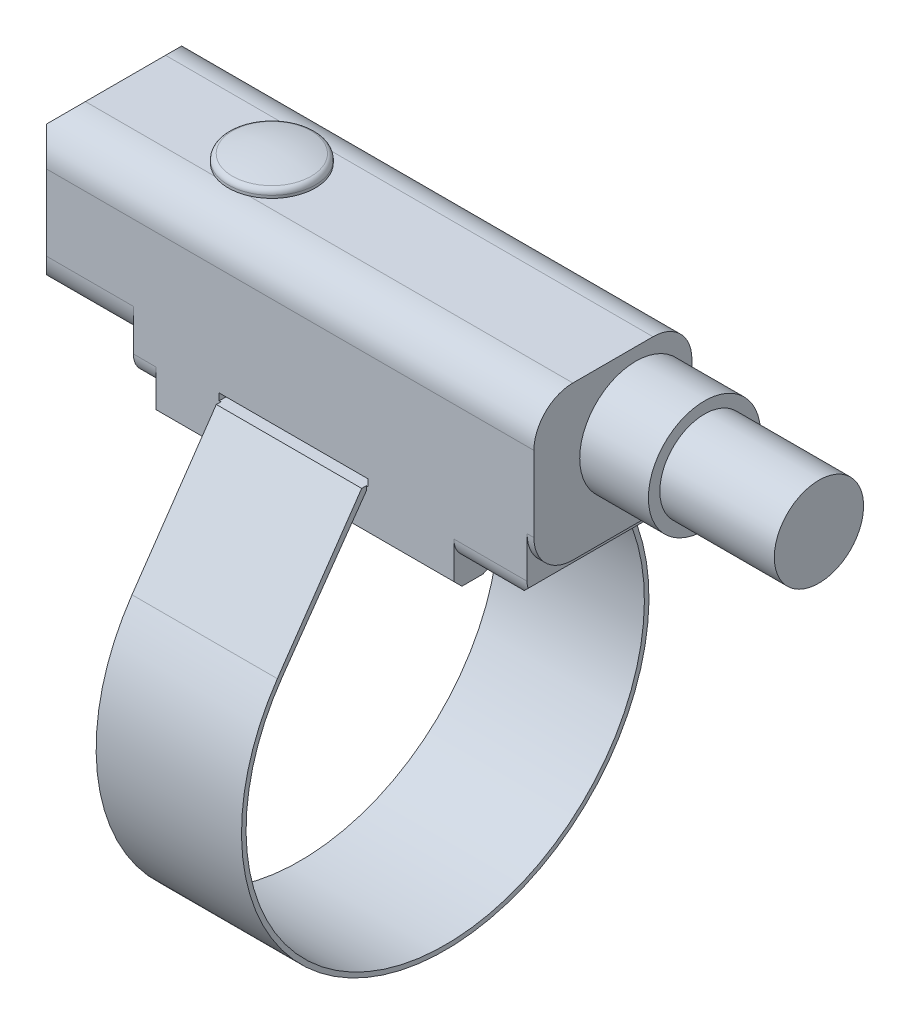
ISO-10303-21;
HEADER;
FILE_DESCRIPTION(('STEP AP214'),'2;1');
FILE_NAME('part.step','',(''),(''),'','','');
FILE_SCHEMA(('AUTOMOTIVE_DESIGN { 1 0 10303 214 1 1 1 1 }'));
ENDSEC;
DATA;
#1=APPLICATION_CONTEXT('core data for automotive mechanical design processes');
#2=APPLICATION_PROTOCOL_DEFINITION('international standard','automotive_design',2000,#1);
#3=PRODUCT_CONTEXT('',#1,'mechanical');
#4=PRODUCT('Part','Part','',(#3));
#5=PRODUCT_RELATED_PRODUCT_CATEGORY('part','',(#4));
#6=PRODUCT_DEFINITION_FORMATION('','',#4);
#7=PRODUCT_DEFINITION_CONTEXT('part definition',#1,'design');
#8=PRODUCT_DEFINITION('design','',#6,#7);
#9=PRODUCT_DEFINITION_SHAPE('','',#8);
#10=(LENGTH_UNIT() NAMED_UNIT(*) SI_UNIT(.MILLI.,.METRE.));
#11=(NAMED_UNIT(*) PLANE_ANGLE_UNIT() SI_UNIT($,.RADIAN.));
#12=(NAMED_UNIT(*) SI_UNIT($,.STERADIAN.) SOLID_ANGLE_UNIT());
#13=UNCERTAINTY_MEASURE_WITH_UNIT(LENGTH_MEASURE(1.E-05),#10,'distance_accuracy_value','');
#14=(GEOMETRIC_REPRESENTATION_CONTEXT(3) GLOBAL_UNCERTAINTY_ASSIGNED_CONTEXT((#13)) GLOBAL_UNIT_ASSIGNED_CONTEXT((#10,
#11,#12)) REPRESENTATION_CONTEXT('',''));
#15=CARTESIAN_POINT('',(0.,0.,0.));
#16=DIRECTION('',(0.,0.,1.));
#17=DIRECTION('',(1.,0.,0.));
#18=AXIS2_PLACEMENT_3D('',#15,#16,#17);
#19=CARTESIAN_POINT('',(30.,14.1,-1.));
#20=DIRECTION('',(1.,0.,0.));
#21=DIRECTION('',(0.,0.,-1.));
#22=AXIS2_PLACEMENT_3D('',#19,#20,#21);
#23=PLANE('',#22);
#24=CARTESIAN_POINT('',(30.,14.1,-1.));
#25=DIRECTION('',(-1.,0.,0.));
#26=DIRECTION('',(0.,0.,1.));
#27=AXIS2_PLACEMENT_3D('',#24,#25,#26);
#28=CIRCLE('',#27,1.95);
#29=CARTESIAN_POINT('',(30.,14.1,0.95));
#30=VERTEX_POINT('',#29);
#31=EDGE_CURVE('E20',#30,#30,#28,.T.);
#32=ORIENTED_EDGE('',*,*,#31,.F.);
#33=EDGE_LOOP('',(#32));
#34=FACE_BOUND('',#33,.T.);
#35=ADVANCED_FACE('F17',(#34),#23,.T.);
#36=CARTESIAN_POINT('',(7.1,11.5299999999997,0.));
#37=DIRECTION('',(0.,0.,1.));
#38=DIRECTION('',(0.,1.,0.));
#39=AXIS2_PLACEMENT_3D('',#36,#37,#38);
#40=SPHERICAL_SURFACE('',#39,6.17000000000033);
#41=CARTESIAN_POINT('',(7.1,17.4555045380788,0.));
#42=DIRECTION('',(0.,-1.,0.));
#43=DIRECTION('',(0.,0.,-1.));
#44=AXIS2_PLACEMENT_3D('',#41,#42,#43);
#45=CIRCLE('',#44,1.7196790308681);
#46=CARTESIAN_POINT('',(7.1,17.4555045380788,-1.7196790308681));
#47=VERTEX_POINT('',#46);
#48=EDGE_CURVE('E695',#47,#47,#45,.T.);
#49=ORIENTED_EDGE('',*,*,#48,.F.);
#50=EDGE_LOOP('',(#49));
#51=FACE_BOUND('',#50,.T.);
#52=ADVANCED_FACE('F599',(#51),#40,.T.);
#53=CARTESIAN_POINT('',(30.,14.1,-1.));
#54=DIRECTION('',(-1.,0.,0.));
#55=DIRECTION('',(0.,0.,1.));
#56=AXIS2_PLACEMENT_3D('',#53,#54,#55);
#57=CYLINDRICAL_SURFACE('',#56,1.95);
#58=ORIENTED_EDGE('',*,*,#31,.T.);
#59=EDGE_LOOP('',(#58));
#60=FACE_BOUND('',#59,.T.);
#61=CARTESIAN_POINT('',(25.,14.1,-1.));
#62=DIRECTION('',(-1.,0.,0.));
#63=DIRECTION('',(0.,0.,1.));
#64=AXIS2_PLACEMENT_3D('',#61,#62,#63);
#65=CIRCLE('',#64,1.95);
#66=CARTESIAN_POINT('',(25.,14.1,0.95));
#67=VERTEX_POINT('',#66);
#68=EDGE_CURVE('E324',#67,#67,#65,.T.);
#69=ORIENTED_EDGE('',*,*,#68,.F.);
#70=EDGE_LOOP('',(#69));
#71=FACE_BOUND('',#70,.T.);
#72=ADVANCED_FACE('F595',(#60,#71),#57,.T.);
#73=CARTESIAN_POINT('',(7.1,17.215411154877,0.));
#74=DIRECTION('',(0.,-1.,0.));
#75=DIRECTION('',(0.,0.,-1.));
#76=AXIS2_PLACEMENT_3D('',#73,#74,#75);
#77=TOROIDAL_SURFACE('',#76,1.64999999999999,0.250000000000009);
#78=ORIENTED_EDGE('',*,*,#48,.T.);
#79=EDGE_LOOP('',(#78));
#80=FACE_BOUND('',#79,.T.);
#81=CARTESIAN_POINT('',(7.1,17.215411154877,0.));
#82=DIRECTION('',(0.,-1.,0.));
#83=DIRECTION('',(0.,0.,-1.));
#84=AXIS2_PLACEMENT_3D('',#81,#82,#83);
#85=CIRCLE('',#84,1.9);
#86=CARTESIAN_POINT('',(7.1,17.215411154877,-1.9));
#87=VERTEX_POINT('',#86);
#88=EDGE_CURVE('E561',#87,#87,#85,.T.);
#89=ORIENTED_EDGE('',*,*,#88,.F.);
#90=EDGE_LOOP('',(#89));
#91=FACE_BOUND('',#90,.T.);
#92=ADVANCED_FACE('F590',(#80,#91),#77,.T.);
#93=CARTESIAN_POINT('',(25.,14.1,-1.));
#94=DIRECTION('',(1.,0.,0.));
#95=DIRECTION('',(0.,0.,-1.));
#96=AXIS2_PLACEMENT_3D('',#93,#94,#95);
#97=PLANE('',#96);
#98=ORIENTED_EDGE('',*,*,#68,.T.);
#99=EDGE_LOOP('',(#98));
#100=FACE_BOUND('',#99,.T.);
#101=CARTESIAN_POINT('',(25.,14.1,-1.));
#102=DIRECTION('',(-1.,0.,0.));
#103=DIRECTION('',(0.,0.,1.));
#104=AXIS2_PLACEMENT_3D('',#101,#102,#103);
#105=CIRCLE('',#104,2.45);
#106=CARTESIAN_POINT('',(25.,14.1,1.45));
#107=VERTEX_POINT('',#106);
#108=EDGE_CURVE('E468',#107,#107,#105,.T.);
#109=ORIENTED_EDGE('',*,*,#108,.F.);
#110=EDGE_LOOP('',(#109));
#111=FACE_BOUND('',#110,.T.);
#112=ADVANCED_FACE('F594',(#100,#111),#97,.T.);
#113=CARTESIAN_POINT('',(18.5,15.4,-1.75000000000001));
#114=DIRECTION('',(1.,0.,0.));
#115=DIRECTION('',(0.,0.,-1.));
#116=AXIS2_PLACEMENT_3D('',#113,#114,#115);
#117=PLANE('',#116);
#118=DIRECTION('',(0.,1.,0.));
#119=VECTOR('',#118,1.);
#120=CARTESIAN_POINT('',(18.5,15.4,-3.45));
#121=LINE('',#120,#119);
#122=CARTESIAN_POINT('',(18.5,8.68662005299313,-3.45));
#123=VERTEX_POINT('',#122);
#124=CARTESIAN_POINT('',(18.5,10.3,-3.45));
#125=VERTEX_POINT('',#124);
#126=EDGE_CURVE('E544',#123,#125,#121,.T.);
#127=ORIENTED_EDGE('',*,*,#126,.T.);
#128=CARTESIAN_POINT('',(18.5,10.3,-2.45));
#129=DIRECTION('',(-1.,0.,0.));
#130=DIRECTION('',(0.,0.,1.));
#131=AXIS2_PLACEMENT_3D('',#128,#129,#130);
#132=CIRCLE('',#131,1.);
#133=CARTESIAN_POINT('',(18.5,9.3,-2.45));
#134=VERTEX_POINT('',#133);
#135=EDGE_CURVE('E330',#125,#134,#132,.T.);
#136=ORIENTED_EDGE('',*,*,#135,.T.);
#137=DIRECTION('',(0.,0.,1.));
#138=VECTOR('',#137,1.);
#139=CARTESIAN_POINT('',(18.5,9.3,2.45));
#140=LINE('',#139,#138);
#141=CARTESIAN_POINT('',(18.5,9.3,2.45));
#142=VERTEX_POINT('',#141);
#143=EDGE_CURVE('E327',#134,#142,#140,.T.);
#144=ORIENTED_EDGE('',*,*,#143,.T.);
#145=CARTESIAN_POINT('',(18.5,10.3,2.44999999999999));
#146=DIRECTION('',(-1.,0.,0.));
#147=DIRECTION('',(0.,0.,1.));
#148=AXIS2_PLACEMENT_3D('',#145,#146,#147);
#149=CIRCLE('',#148,1.00000000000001);
#150=CARTESIAN_POINT('',(18.5,10.3,3.45));
#151=VERTEX_POINT('',#150);
#152=EDGE_CURVE('E313',#142,#151,#149,.T.);
#153=ORIENTED_EDGE('',*,*,#152,.T.);
#154=DIRECTION('',(0.,1.,0.));
#155=VECTOR('',#154,1.);
#156=CARTESIAN_POINT('',(18.5,15.4,3.45));
#157=LINE('',#156,#155);
#158=CARTESIAN_POINT('',(18.5,8.68662005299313,3.45));
#159=VERTEX_POINT('',#158);
#160=EDGE_CURVE('E323',#151,#159,#157,.F.);
#161=ORIENTED_EDGE('',*,*,#160,.T.);
#162=DIRECTION('',(0.,-0.707106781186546,-0.707106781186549));
#163=VECTOR('',#162,1.);
#164=CARTESIAN_POINT('',(18.5,8.68662005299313,3.45));
#165=LINE('',#164,#163);
#166=CARTESIAN_POINT('',(18.5,8.33306666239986,3.09644660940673));
#167=VERTEX_POINT('',#166);
#168=EDGE_CURVE('E551',#159,#167,#165,.T.);
#169=ORIENTED_EDGE('',*,*,#168,.T.);
#170=DIRECTION('',(0.,0.,-1.));
#171=VECTOR('',#170,1.);
#172=CARTESIAN_POINT('',(18.5,8.33306666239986,-1.75000000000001));
#173=LINE('',#172,#171);
#174=CARTESIAN_POINT('',(18.5,8.33306666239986,2.18));
#175=VERTEX_POINT('',#174);
#176=EDGE_CURVE('E549',#167,#175,#173,.T.);
#177=ORIENTED_EDGE('',*,*,#176,.T.);
#178=CARTESIAN_POINT('',(18.5,3.83333333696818,0.));
#179=DIRECTION('',(-1.,0.,0.));
#180=DIRECTION('',(0.,0.,1.));
#181=AXIS2_PLACEMENT_3D('',#178,#179,#180);
#182=CIRCLE('',#181,5.00000000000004);
#183=CARTESIAN_POINT('',(18.5,8.33306666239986,-2.18));
#184=VERTEX_POINT('',#183);
#185=EDGE_CURVE('E691',#175,#184,#182,.T.);
#186=ORIENTED_EDGE('',*,*,#185,.T.);
#187=DIRECTION('',(0.,0.,1.));
#188=VECTOR('',#187,1.);
#189=CARTESIAN_POINT('',(18.5,8.33306666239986,-2.5));
#190=LINE('',#189,#188);
#191=CARTESIAN_POINT('',(18.5,8.33306666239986,-3.09644660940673));
#192=VERTEX_POINT('',#191);
#193=EDGE_CURVE('E560',#184,#192,#190,.F.);
#194=ORIENTED_EDGE('',*,*,#193,.T.);
#195=DIRECTION('',(0.,0.707106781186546,-0.707106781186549));
#196=VECTOR('',#195,1.);
#197=CARTESIAN_POINT('',(18.5,8.33306666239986,-3.09644660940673));
#198=LINE('',#197,#196);
#199=EDGE_CURVE('E546',#192,#123,#198,.T.);
#200=ORIENTED_EDGE('',*,*,#199,.T.);
#201=EDGE_LOOP('',(#127,#136,#144,#153,#161,#169,#177,#186,#194,#200));
#202=FACE_BOUND('',#201,.T.);
#203=ADVANCED_FACE('F329',(#202),#117,.T.);
#204=CARTESIAN_POINT('',(18.5,3.83333333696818,0.));
#205=DIRECTION('',(-1.,0.,0.));
#206=DIRECTION('',(0.,0.,1.));
#207=AXIS2_PLACEMENT_3D('',#204,#205,#206);
#208=CYLINDRICAL_SURFACE('',#207,5.00000000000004);
#209=ORIENTED_EDGE('',*,*,#185,.F.);
#210=DIRECTION('',(1.,0.,0.));
#211=VECTOR('',#210,1.);
#212=CARTESIAN_POINT('',(18.5,8.33306666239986,2.18));
#213=LINE('',#212,#211);
#214=CARTESIAN_POINT('',(5.5,8.33306666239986,2.18));
#215=VERTEX_POINT('',#214);
#216=EDGE_CURVE('E456',#175,#215,#213,.F.);
#217=ORIENTED_EDGE('',*,*,#216,.T.);
#218=CARTESIAN_POINT('',(5.5,3.83333333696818,0.));
#219=DIRECTION('',(-1.,0.,0.));
#220=DIRECTION('',(0.,0.,1.));
#221=AXIS2_PLACEMENT_3D('',#218,#219,#220);
#222=CIRCLE('',#221,5.00000000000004);
#223=CARTESIAN_POINT('',(5.5,8.33306666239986,-2.18));
#224=VERTEX_POINT('',#223);
#225=EDGE_CURVE('E537',#224,#215,#222,.F.);
#226=ORIENTED_EDGE('',*,*,#225,.F.);
#227=DIRECTION('',(1.,0.,0.));
#228=VECTOR('',#227,1.);
#229=CARTESIAN_POINT('',(18.5,8.33306666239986,-2.18));
#230=LINE('',#229,#228);
#231=EDGE_CURVE('E557',#224,#184,#230,.T.);
#232=ORIENTED_EDGE('',*,*,#231,.T.);
#233=EDGE_LOOP('',(#209,#217,#226,#232));
#234=FACE_BOUND('',#233,.T.);
#235=ADVANCED_FACE('F895',(#234),#208,.F.);
#236=CARTESIAN_POINT('',(5.5,10.3,-2.45));
#237=DIRECTION('',(-1.,0.,0.));
#238=DIRECTION('',(0.,0.,1.));
#239=AXIS2_PLACEMENT_3D('',#236,#237,#238);
#240=PLANE('',#239);
#241=DIRECTION('',(0.,1.,0.));
#242=VECTOR('',#241,1.);
#243=CARTESIAN_POINT('',(5.5,10.3,-3.45));
#244=LINE('',#243,#242);
#245=CARTESIAN_POINT('',(5.5,10.3,-3.45));
#246=VERTEX_POINT('',#245);
#247=CARTESIAN_POINT('',(5.5,8.68662005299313,-3.45));
#248=VERTEX_POINT('',#247);
#249=EDGE_CURVE('E517',#246,#248,#244,.F.);
#250=ORIENTED_EDGE('',*,*,#249,.T.);
#251=DIRECTION('',(0.,-0.707106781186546,0.707106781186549));
#252=VECTOR('',#251,1.);
#253=CARTESIAN_POINT('',(5.5,8.68662005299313,-3.45));
#254=LINE('',#253,#252);
#255=CARTESIAN_POINT('',(5.5,8.33306666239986,-3.09644660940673));
#256=VERTEX_POINT('',#255);
#257=EDGE_CURVE('E514',#248,#256,#254,.T.);
#258=ORIENTED_EDGE('',*,*,#257,.T.);
#259=DIRECTION('',(0.,0.,1.));
#260=VECTOR('',#259,1.);
#261=CARTESIAN_POINT('',(5.5,8.33306666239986,-2.5));
#262=LINE('',#261,#260);
#263=EDGE_CURVE('E562',#256,#224,#262,.T.);
#264=ORIENTED_EDGE('',*,*,#263,.T.);
#265=ORIENTED_EDGE('',*,*,#225,.T.);
#266=DIRECTION('',(0.,0.,1.));
#267=VECTOR('',#266,1.);
#268=CARTESIAN_POINT('',(5.5,8.33306666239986,3.09644660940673));
#269=LINE('',#268,#267);
#270=CARTESIAN_POINT('',(5.5,8.33306666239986,3.09644660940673));
#271=VERTEX_POINT('',#270);
#272=EDGE_CURVE('E455',#215,#271,#269,.T.);
#273=ORIENTED_EDGE('',*,*,#272,.T.);
#274=DIRECTION('',(0.,0.707106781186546,0.707106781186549));
#275=VECTOR('',#274,1.);
#276=CARTESIAN_POINT('',(5.5,8.33306666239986,3.09644660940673));
#277=LINE('',#276,#275);
#278=CARTESIAN_POINT('',(5.5,8.68662005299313,3.45));
#279=VERTEX_POINT('',#278);
#280=EDGE_CURVE('E527',#271,#279,#277,.T.);
#281=ORIENTED_EDGE('',*,*,#280,.T.);
#282=DIRECTION('',(0.,1.,0.));
#283=VECTOR('',#282,1.);
#284=CARTESIAN_POINT('',(5.5,10.3,3.45));
#285=LINE('',#284,#283);
#286=CARTESIAN_POINT('',(5.5,10.3,3.45));
#287=VERTEX_POINT('',#286);
#288=EDGE_CURVE('E523',#279,#287,#285,.T.);
#289=ORIENTED_EDGE('',*,*,#288,.T.);
#290=CARTESIAN_POINT('',(5.5,10.3,2.45));
#291=DIRECTION('',(-1.,0.,0.));
#292=DIRECTION('',(0.,0.,1.));
#293=AXIS2_PLACEMENT_3D('',#290,#291,#292);
#294=CIRCLE('',#293,1.);
#295=CARTESIAN_POINT('',(5.5,9.3,2.45));
#296=VERTEX_POINT('',#295);
#297=EDGE_CURVE('E526',#287,#296,#294,.F.);
#298=ORIENTED_EDGE('',*,*,#297,.T.);
#299=DIRECTION('',(0.,0.,-1.));
#300=VECTOR('',#299,1.);
#301=CARTESIAN_POINT('',(5.5,9.3,-2.45));
#302=LINE('',#301,#300);
#303=CARTESIAN_POINT('',(5.5,9.3,-2.45));
#304=VERTEX_POINT('',#303);
#305=EDGE_CURVE('E446',#304,#296,#302,.F.);
#306=ORIENTED_EDGE('',*,*,#305,.F.);
#307=CARTESIAN_POINT('',(5.5,10.3,-2.45));
#308=DIRECTION('',(-1.,0.,0.));
#309=DIRECTION('',(0.,0.,1.));
#310=AXIS2_PLACEMENT_3D('',#307,#308,#309);
#311=CIRCLE('',#310,1.00000000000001);
#312=EDGE_CURVE('E520',#304,#246,#311,.F.);
#313=ORIENTED_EDGE('',*,*,#312,.T.);
#314=EDGE_LOOP('',(#250,#258,#264,#265,#273,#281,#289,#298,#306,#313));
#315=FACE_BOUND('',#314,.T.);
#316=ADVANCED_FACE('F891',(#315),#240,.T.);
#317=CARTESIAN_POINT('',(0.707106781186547,10.4,-5.));
#318=DIRECTION('',(0.707106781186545,0.70710678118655,0.));
#319=DIRECTION('',(-0.70710678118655,0.707106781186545,0.));
#320=AXIS2_PLACEMENT_3D('',#317,#318,#319);
#321=PLANE('',#320);
#322=DIRECTION('',(-0.577350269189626,0.577350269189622,0.57735026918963));
#323=VECTOR('',#322,1.);
#324=CARTESIAN_POINT('',(0.209188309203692,10.8979184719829,-2.95208152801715));
#325=LINE('',#324,#323);
#326=CARTESIAN_POINT('',(0.209188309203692,10.8979184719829,-2.95208152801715));
#327=VERTEX_POINT('',#326);
#328=CARTESIAN_POINT('',(0.,11.1071067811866,-2.74289321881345));
#329=VERTEX_POINT('',#328);
#330=EDGE_CURVE('E506',#327,#329,#325,.T.);
#331=ORIENTED_EDGE('',*,*,#330,.F.);
#332=CARTESIAN_POINT('',(-0.992893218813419,12.1,-1.75000000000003));
#333=DIRECTION('',(0.707106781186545,0.70710678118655,0.));
#334=DIRECTION('',(-0.70710678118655,0.707106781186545,0.));
#335=AXIS2_PLACEMENT_3D('',#332,#333,#334);
#336=ELLIPSE('',#335,2.40416305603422,1.69999999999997);
#337=CARTESIAN_POINT('',(0.707106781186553,10.4,-1.75000000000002));
#338=VERTEX_POINT('',#337);
#339=EDGE_CURVE('E508',#338,#327,#336,.T.);
#340=ORIENTED_EDGE('',*,*,#339,.F.);
#341=DIRECTION('',(0.,0.,-1.));
#342=VECTOR('',#341,1.);
#343=CARTESIAN_POINT('',(0.707106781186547,10.4,-1.75));
#344=LINE('',#343,#342);
#345=CARTESIAN_POINT('',(0.707106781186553,10.4,1.75000000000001));
#346=VERTEX_POINT('',#345);
#347=EDGE_CURVE('E442',#346,#338,#344,.T.);
#348=ORIENTED_EDGE('',*,*,#347,.F.);
#349=CARTESIAN_POINT('',(-0.992893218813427,12.1,1.75000000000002));
#350=DIRECTION('',(0.707106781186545,0.70710678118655,0.));
#351=DIRECTION('',(-0.70710678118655,0.707106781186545,0.));
#352=AXIS2_PLACEMENT_3D('',#349,#350,#351);
#353=ELLIPSE('',#352,2.40416305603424,1.69999999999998);
#354=CARTESIAN_POINT('',(0.209188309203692,10.8979184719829,2.95208152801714));
#355=VERTEX_POINT('',#354);
#356=EDGE_CURVE('E513',#355,#346,#353,.T.);
#357=ORIENTED_EDGE('',*,*,#356,.F.);
#358=DIRECTION('',(0.577350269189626,-0.577350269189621,0.577350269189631));
#359=VECTOR('',#358,1.);
#360=CARTESIAN_POINT('',(0.,11.1071067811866,2.74289321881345));
#361=LINE('',#360,#359);
#362=CARTESIAN_POINT('',(0.,11.1071067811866,2.74289321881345));
#363=VERTEX_POINT('',#362);
#364=EDGE_CURVE('E511',#363,#355,#361,.T.);
#365=ORIENTED_EDGE('',*,*,#364,.F.);
#366=DIRECTION('',(0.,0.,-1.));
#367=VECTOR('',#366,1.);
#368=CARTESIAN_POINT('',(0.,11.1071067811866,-1.75000000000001));
#369=LINE('',#368,#367);
#370=EDGE_CURVE('E445',#363,#329,#369,.T.);
#371=ORIENTED_EDGE('',*,*,#370,.T.);
#372=EDGE_LOOP('',(#331,#340,#348,#357,#365,#371));
#373=FACE_BOUND('',#372,.T.);
#374=ADVANCED_FACE('F887',(#373),#321,.F.);
#375=CARTESIAN_POINT('',(0.,16.3928932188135,-5.));
#376=DIRECTION('',(0.707106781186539,-0.707106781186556,0.));
#377=DIRECTION('',(0.707106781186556,0.707106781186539,0.));
#378=AXIS2_PLACEMENT_3D('',#375,#376,#377);
#379=PLANE('',#378);
#380=DIRECTION('',(0.57735026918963,0.577350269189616,-0.577350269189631));
#381=VECTOR('',#380,1.);
#382=CARTESIAN_POINT('',(0.,16.3928932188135,-2.74289321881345));
#383=LINE('',#382,#381);
#384=CARTESIAN_POINT('',(0.,16.3928932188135,-2.74289321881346));
#385=VERTEX_POINT('',#384);
#386=CARTESIAN_POINT('',(0.209188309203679,16.6020815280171,-2.95208152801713));
#387=VERTEX_POINT('',#386);
#388=EDGE_CURVE('E496',#385,#387,#383,.T.);
#389=ORIENTED_EDGE('',*,*,#388,.F.);
#390=DIRECTION('',(0.,0.,-1.));
#391=VECTOR('',#390,1.);
#392=CARTESIAN_POINT('',(0.,16.3928932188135,-1.75000000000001));
#393=LINE('',#392,#391);
#394=CARTESIAN_POINT('',(0.,16.3928932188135,2.74289321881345));
#395=VERTEX_POINT('',#394);
#396=EDGE_CURVE('E587',#385,#395,#393,.F.);
#397=ORIENTED_EDGE('',*,*,#396,.T.);
#398=DIRECTION('',(-0.577350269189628,-0.577350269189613,-0.577350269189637));
#399=VECTOR('',#398,1.);
#400=CARTESIAN_POINT('',(0.20918830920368,16.6020815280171,2.95208152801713));
#401=LINE('',#400,#399);
#402=CARTESIAN_POINT('',(0.20918830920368,16.6020815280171,2.95208152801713));
#403=VERTEX_POINT('',#402);
#404=EDGE_CURVE('E499',#403,#395,#401,.T.);
#405=ORIENTED_EDGE('',*,*,#404,.F.);
#406=CARTESIAN_POINT('',(-0.992893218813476,15.4,1.75000000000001));
#407=DIRECTION('',(0.707106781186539,-0.707106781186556,0.));
#408=DIRECTION('',(-0.707106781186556,-0.707106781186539,0.));
#409=AXIS2_PLACEMENT_3D('',#406,#407,#408);
#410=ELLIPSE('',#409,2.40416305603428,1.69999999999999);
#411=CARTESIAN_POINT('',(0.707106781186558,17.1,1.75));
#412=VERTEX_POINT('',#411);
#413=EDGE_CURVE('E503',#412,#403,#410,.T.);
#414=ORIENTED_EDGE('',*,*,#413,.F.);
#415=DIRECTION('',(0.,0.,-1.));
#416=VECTOR('',#415,1.);
#417=CARTESIAN_POINT('',(0.707106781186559,17.1,-1.75));
#418=LINE('',#417,#416);
#419=CARTESIAN_POINT('',(0.707106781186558,17.1,-1.75000000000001));
#420=VERTEX_POINT('',#419);
#421=EDGE_CURVE('E435',#412,#420,#418,.T.);
#422=ORIENTED_EDGE('',*,*,#421,.T.);
#423=CARTESIAN_POINT('',(-0.992893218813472,15.4,-1.75000000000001));
#424=DIRECTION('',(0.707106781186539,-0.707106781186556,0.));
#425=DIRECTION('',(-0.707106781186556,-0.707106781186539,0.));
#426=AXIS2_PLACEMENT_3D('',#423,#424,#425);
#427=ELLIPSE('',#426,2.40416305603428,1.69999999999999);
#428=EDGE_CURVE('E498',#387,#420,#427,.T.);
#429=ORIENTED_EDGE('',*,*,#428,.F.);
#430=EDGE_LOOP('',(#389,#397,#405,#414,#422,#429));
#431=FACE_BOUND('',#430,.T.);
#432=ADVANCED_FACE('F883',(#431),#379,.F.);
#433=CARTESIAN_POINT('',(7.1,17.7,0.));
#434=DIRECTION('',(0.,-1.,0.));
#435=DIRECTION('',(0.,0.,-1.));
#436=AXIS2_PLACEMENT_3D('',#433,#434,#435);
#437=CYLINDRICAL_SURFACE('',#436,1.9);
#438=ORIENTED_EDGE('',*,*,#88,.T.);
#439=EDGE_LOOP('',(#438));
#440=FACE_BOUND('',#439,.T.);
#441=CARTESIAN_POINT('',(7.1,17.1,0.));
#442=DIRECTION('',(0.,-1.,0.));
#443=DIRECTION('',(0.,0.,-1.));
#444=AXIS2_PLACEMENT_3D('',#441,#442,#443);
#445=CIRCLE('',#444,1.9);
#446=CARTESIAN_POINT('',(6.36006757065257,17.1,-1.75));
#447=VERTEX_POINT('',#446);
#448=CARTESIAN_POINT('',(6.36006757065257,17.1,1.75));
#449=VERTEX_POINT('',#448);
#450=EDGE_CURVE('E427',#447,#449,#445,.F.);
#451=ORIENTED_EDGE('',*,*,#450,.T.);
#452=CARTESIAN_POINT('',(7.1,17.1,0.));
#453=DIRECTION('',(0.,-1.,0.));
#454=DIRECTION('',(0.,0.,-1.));
#455=AXIS2_PLACEMENT_3D('',#452,#453,#454);
#456=CIRCLE('',#455,1.9);
#457=CARTESIAN_POINT('',(7.83993242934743,17.1,1.75));
#458=VERTEX_POINT('',#457);
#459=EDGE_CURVE('E438',#449,#458,#456,.F.);
#460=ORIENTED_EDGE('',*,*,#459,.T.);
#461=CARTESIAN_POINT('',(7.1,17.1,0.));
#462=DIRECTION('',(0.,-1.,0.));
#463=DIRECTION('',(0.,0.,-1.));
#464=AXIS2_PLACEMENT_3D('',#461,#462,#463);
#465=CIRCLE('',#464,1.9);
#466=CARTESIAN_POINT('',(7.83993242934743,17.1,-1.75));
#467=VERTEX_POINT('',#466);
#468=EDGE_CURVE('E675',#458,#467,#465,.F.);
#469=ORIENTED_EDGE('',*,*,#468,.T.);
#470=CARTESIAN_POINT('',(7.1,17.1,0.));
#471=DIRECTION('',(0.,-1.,0.));
#472=DIRECTION('',(0.,0.,-1.));
#473=AXIS2_PLACEMENT_3D('',#470,#471,#472);
#474=CIRCLE('',#473,1.9);
#475=EDGE_CURVE('E565',#467,#447,#474,.F.);
#476=ORIENTED_EDGE('',*,*,#475,.T.);
#477=EDGE_LOOP('',(#451,#460,#469,#476));
#478=FACE_BOUND('',#477,.T.);
#479=ADVANCED_FACE('F879',(#440,#478),#437,.T.);
#480=CARTESIAN_POINT('',(18.5,8.33306666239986,-2.5));
#481=DIRECTION('',(0.,1.,0.));
#482=DIRECTION('',(0.,0.,1.));
#483=AXIS2_PLACEMENT_3D('',#480,#481,#482);
#484=PLANE('',#483);
#485=DIRECTION('',(1.,0.,0.));
#486=VECTOR('',#485,1.);
#487=CARTESIAN_POINT('',(18.5,8.33306666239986,-3.09644660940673));
#488=LINE('',#487,#486);
#489=EDGE_CURVE('E452',#256,#192,#488,.T.);
#490=ORIENTED_EDGE('',*,*,#489,.T.);
#491=ORIENTED_EDGE('',*,*,#193,.F.);
#492=ORIENTED_EDGE('',*,*,#231,.F.);
#493=ORIENTED_EDGE('',*,*,#263,.F.);
#494=EDGE_LOOP('',(#490,#491,#492,#493));
#495=FACE_BOUND('',#494,.T.);
#496=ADVANCED_FACE('F875',(#495),#484,.F.);
#497=CARTESIAN_POINT('',(7.1,17.1,0.));
#498=DIRECTION('',(0.,1.,0.));
#499=DIRECTION('',(0.,0.,1.));
#500=AXIS2_PLACEMENT_3D('',#497,#498,#499);
#501=PLANE('',#500);
#502=ORIENTED_EDGE('',*,*,#475,.F.);
#503=DIRECTION('',(-1.,0.,0.));
#504=VECTOR('',#503,1.);
#505=CARTESIAN_POINT('',(18.5,17.1,-1.75));
#506=LINE('',#505,#504);
#507=EDGE_CURVE('E381',#447,#467,#506,.F.);
#508=ORIENTED_EDGE('',*,*,#507,.F.);
#509=EDGE_LOOP('',(#502,#508));
#510=FACE_BOUND('',#509,.T.);
#511=ADVANCED_FACE('F871',(#510),#501,.F.);
#512=CARTESIAN_POINT('',(25.,14.1,-1.));
#513=DIRECTION('',(-1.,0.,0.));
#514=DIRECTION('',(0.,0.,1.));
#515=AXIS2_PLACEMENT_3D('',#512,#513,#514);
#516=CYLINDRICAL_SURFACE('',#515,2.45);
#517=CARTESIAN_POINT('',(22.,14.1,-1.));
#518=DIRECTION('',(-1.,0.,0.));
#519=DIRECTION('',(0.,0.,1.));
#520=AXIS2_PLACEMENT_3D('',#517,#518,#519);
#521=CIRCLE('',#520,2.45);
#522=CARTESIAN_POINT('',(22.,14.1,1.45));
#523=VERTEX_POINT('',#522);
#524=EDGE_CURVE('E650',#523,#523,#521,.T.);
#525=ORIENTED_EDGE('',*,*,#524,.F.);
#526=EDGE_LOOP('',(#525));
#527=FACE_BOUND('',#526,.T.);
#528=ORIENTED_EDGE('',*,*,#108,.T.);
#529=EDGE_LOOP('',(#528));
#530=FACE_BOUND('',#529,.T.);
#531=ADVANCED_FACE('F867',(#527,#530),#516,.T.);
#532=CARTESIAN_POINT('',(22.,12.1,1.75000000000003));
#533=DIRECTION('',(-1.,0.,0.));
#534=DIRECTION('',(0.,0.,1.));
#535=AXIS2_PLACEMENT_3D('',#532,#533,#534);
#536=CYLINDRICAL_SURFACE('',#535,1.69999999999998);
#537=CARTESIAN_POINT('',(22.,12.1,1.75000000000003));
#538=DIRECTION('',(-1.,0.,0.));
#539=DIRECTION('',(0.,0.,1.));
#540=AXIS2_PLACEMENT_3D('',#537,#538,#539);
#541=CIRCLE('',#540,1.69999999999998);
#542=CARTESIAN_POINT('',(22.,12.1,3.45));
#543=VERTEX_POINT('',#542);
#544=CARTESIAN_POINT('',(22.,10.4,1.75000000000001));
#545=VERTEX_POINT('',#544);
#546=EDGE_CURVE('E659',#543,#545,#541,.F.);
#547=ORIENTED_EDGE('',*,*,#546,.F.);
#548=DIRECTION('',(-1.,0.,0.));
#549=VECTOR('',#548,1.);
#550=CARTESIAN_POINT('',(22.,12.1,3.45));
#551=LINE('',#550,#549);
#552=CARTESIAN_POINT('',(21.7,12.1,3.45));
#553=VERTEX_POINT('',#552);
#554=EDGE_CURVE('E466',#543,#553,#551,.T.);
#555=ORIENTED_EDGE('',*,*,#554,.T.);
#556=CARTESIAN_POINT('',(21.7,12.1,1.75000000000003));
#557=DIRECTION('',(-1.,0.,0.));
#558=DIRECTION('',(0.,0.,1.));
#559=AXIS2_PLACEMENT_3D('',#556,#557,#558);
#560=CIRCLE('',#559,1.69999999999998);
#561=CARTESIAN_POINT('',(21.7,10.4,1.75000000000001));
#562=VERTEX_POINT('',#561);
#563=EDGE_CURVE('E354',#553,#562,#560,.F.);
#564=ORIENTED_EDGE('',*,*,#563,.T.);
#565=DIRECTION('',(1.,0.,0.));
#566=VECTOR('',#565,1.);
#567=CARTESIAN_POINT('',(22.,10.4,1.75));
#568=LINE('',#567,#566);
#569=EDGE_CURVE('E464',#562,#545,#568,.T.);
#570=ORIENTED_EDGE('',*,*,#569,.T.);
#571=EDGE_LOOP('',(#547,#555,#564,#570));
#572=FACE_BOUND('',#571,.T.);
#573=ADVANCED_FACE('F863',(#572),#536,.T.);
#574=CARTESIAN_POINT('',(22.,10.4,1.75));
#575=DIRECTION('',(0.,1.,0.));
#576=DIRECTION('',(0.,0.,1.));
#577=AXIS2_PLACEMENT_3D('',#574,#575,#576);
#578=PLANE('',#577);
#579=DIRECTION('',(-1.,0.,0.));
#580=VECTOR('',#579,1.);
#581=CARTESIAN_POINT('',(22.,10.4,-1.75));
#582=LINE('',#581,#580);
#583=CARTESIAN_POINT('',(22.,10.4,-1.75000000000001));
#584=VERTEX_POINT('',#583);
#585=CARTESIAN_POINT('',(21.7,10.4,-1.75000000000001));
#586=VERTEX_POINT('',#585);
#587=EDGE_CURVE('E458',#584,#586,#582,.T.);
#588=ORIENTED_EDGE('',*,*,#587,.F.);
#589=DIRECTION('',(0.,0.,-1.));
#590=VECTOR('',#589,1.);
#591=CARTESIAN_POINT('',(22.,10.4,1.75000000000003));
#592=LINE('',#591,#590);
#593=EDGE_CURVE('E656',#545,#584,#592,.T.);
#594=ORIENTED_EDGE('',*,*,#593,.F.);
#595=ORIENTED_EDGE('',*,*,#569,.F.);
#596=DIRECTION('',(0.,0.,1.));
#597=VECTOR('',#596,1.);
#598=CARTESIAN_POINT('',(21.7,10.4,1.75000000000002));
#599=LINE('',#598,#597);
#600=EDGE_CURVE('E351',#562,#586,#599,.F.);
#601=ORIENTED_EDGE('',*,*,#600,.T.);
#602=EDGE_LOOP('',(#588,#594,#595,#601));
#603=FACE_BOUND('',#602,.T.);
#604=ADVANCED_FACE('F859',(#603),#578,.F.);
#605=CARTESIAN_POINT('',(22.,12.1,-1.75000000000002));
#606=DIRECTION('',(-1.,0.,0.));
#607=DIRECTION('',(0.,0.,1.));
#608=AXIS2_PLACEMENT_3D('',#605,#606,#607);
#609=CYLINDRICAL_SURFACE('',#608,1.69999999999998);
#610=CARTESIAN_POINT('',(22.,12.1,-1.75000000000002));
#611=DIRECTION('',(-1.,0.,0.));
#612=DIRECTION('',(0.,0.,1.));
#613=AXIS2_PLACEMENT_3D('',#610,#611,#612);
#614=CIRCLE('',#613,1.69999999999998);
#615=CARTESIAN_POINT('',(22.,12.1,-3.45));
#616=VERTEX_POINT('',#615);
#617=EDGE_CURVE('E653',#584,#616,#614,.F.);
#618=ORIENTED_EDGE('',*,*,#617,.F.);
#619=ORIENTED_EDGE('',*,*,#587,.T.);
#620=CARTESIAN_POINT('',(21.7,12.1,-1.75000000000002));
#621=DIRECTION('',(-1.,0.,0.));
#622=DIRECTION('',(0.,0.,1.));
#623=AXIS2_PLACEMENT_3D('',#620,#621,#622);
#624=CIRCLE('',#623,1.69999999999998);
#625=CARTESIAN_POINT('',(21.7,12.1,-3.45));
#626=VERTEX_POINT('',#625);
#627=EDGE_CURVE('E353',#586,#626,#624,.F.);
#628=ORIENTED_EDGE('',*,*,#627,.T.);
#629=DIRECTION('',(-1.,0.,0.));
#630=VECTOR('',#629,1.);
#631=CARTESIAN_POINT('',(22.,12.1,-3.45));
#632=LINE('',#631,#630);
#633=EDGE_CURVE('E461',#626,#616,#632,.F.);
#634=ORIENTED_EDGE('',*,*,#633,.T.);
#635=EDGE_LOOP('',(#618,#619,#628,#634));
#636=FACE_BOUND('',#635,.T.);
#637=ADVANCED_FACE('F855',(#636),#609,.T.);
#638=CARTESIAN_POINT('',(21.7,10.0071067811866,-5.));
#639=DIRECTION('',(-0.707106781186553,0.707106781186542,0.));
#640=DIRECTION('',(-0.707106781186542,-0.707106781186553,0.));
#641=AXIS2_PLACEMENT_3D('',#638,#639,#640);
#642=PLANE('',#641);
#643=CARTESIAN_POINT('',(21.9928932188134,10.3,-2.45));
#644=DIRECTION('',(-0.707106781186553,0.707106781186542,0.));
#645=DIRECTION('',(-0.707106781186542,-0.707106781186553,0.));
#646=AXIS2_PLACEMENT_3D('',#643,#644,#645);
#647=ELLIPSE('',#646,1.41421356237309,1.);
#648=CARTESIAN_POINT('',(21.7,10.0071067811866,-3.40614515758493));
#649=VERTEX_POINT('',#648);
#650=CARTESIAN_POINT('',(20.9928932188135,9.3,-2.45));
#651=VERTEX_POINT('',#650);
#652=EDGE_CURVE('E390',#649,#651,#647,.T.);
#653=ORIENTED_EDGE('',*,*,#652,.F.);
#654=DIRECTION('',(0.,0.,1.));
#655=VECTOR('',#654,1.);
#656=CARTESIAN_POINT('',(21.7,10.0071067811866,1.75000000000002));
#657=LINE('',#656,#655);
#658=CARTESIAN_POINT('',(21.7,10.0071067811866,3.40614515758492));
#659=VERTEX_POINT('',#658);
#660=EDGE_CURVE('E340',#649,#659,#657,.T.);
#661=ORIENTED_EDGE('',*,*,#660,.T.);
#662=CARTESIAN_POINT('',(21.9928932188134,10.3,2.44999999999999));
#663=DIRECTION('',(-0.707106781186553,0.707106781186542,0.));
#664=DIRECTION('',(-0.707106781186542,-0.707106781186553,0.));
#665=AXIS2_PLACEMENT_3D('',#662,#663,#664);
#666=ELLIPSE('',#665,1.41421356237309,1.00000000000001);
#667=CARTESIAN_POINT('',(20.9928932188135,9.3,2.45));
#668=VERTEX_POINT('',#667);
#669=EDGE_CURVE('E335',#668,#659,#666,.T.);
#670=ORIENTED_EDGE('',*,*,#669,.F.);
#671=DIRECTION('',(0.,0.,1.));
#672=VECTOR('',#671,1.);
#673=CARTESIAN_POINT('',(20.9928932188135,9.3,2.45));
#674=LINE('',#673,#672);
#675=EDGE_CURVE('E334',#668,#651,#674,.F.);
#676=ORIENTED_EDGE('',*,*,#675,.T.);
#677=EDGE_LOOP('',(#653,#661,#670,#676));
#678=FACE_BOUND('',#677,.T.);
#679=ADVANCED_FACE('F852',(#678),#642,.F.);
#680=CARTESIAN_POINT('',(21.7,9.3,2.45));
#681=DIRECTION('',(0.,1.,0.));
#682=DIRECTION('',(0.,0.,1.));
#683=AXIS2_PLACEMENT_3D('',#680,#681,#682);
#684=PLANE('',#683);
#685=ORIENTED_EDGE('',*,*,#675,.F.);
#686=DIRECTION('',(-1.,0.,0.));
#687=VECTOR('',#686,1.);
#688=CARTESIAN_POINT('',(21.7,9.3,2.45));
#689=LINE('',#688,#687);
#690=EDGE_CURVE('E317',#142,#668,#689,.F.);
#691=ORIENTED_EDGE('',*,*,#690,.F.);
#692=ORIENTED_EDGE('',*,*,#143,.F.);
#693=DIRECTION('',(-1.,0.,0.));
#694=VECTOR('',#693,1.);
#695=CARTESIAN_POINT('',(21.7,9.3,-2.45));
#696=LINE('',#695,#694);
#697=EDGE_CURVE('E382',#651,#134,#696,.T.);
#698=ORIENTED_EDGE('',*,*,#697,.F.);
#699=EDGE_LOOP('',(#685,#691,#692,#698));
#700=FACE_BOUND('',#699,.T.);
#701=ADVANCED_FACE('F338',(#700),#684,.F.);
#702=CARTESIAN_POINT('',(18.5,8.33306666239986,3.09644660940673));
#703=DIRECTION('',(0.,1.,0.));
#704=DIRECTION('',(0.,0.,1.));
#705=AXIS2_PLACEMENT_3D('',#702,#703,#704);
#706=PLANE('',#705);
#707=ORIENTED_EDGE('',*,*,#216,.F.);
#708=ORIENTED_EDGE('',*,*,#176,.F.);
#709=DIRECTION('',(1.,0.,0.));
#710=VECTOR('',#709,1.);
#711=CARTESIAN_POINT('',(18.5,8.33306666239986,3.09644660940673));
#712=LINE('',#711,#710);
#713=EDGE_CURVE('E342',#167,#271,#712,.F.);
#714=ORIENTED_EDGE('',*,*,#713,.T.);
#715=ORIENTED_EDGE('',*,*,#272,.F.);
#716=EDGE_LOOP('',(#707,#708,#714,#715));
#717=FACE_BOUND('',#716,.T.);
#718=ADVANCED_FACE('F845',(#717),#706,.F.);
#719=CARTESIAN_POINT('',(5.5,9.3,-2.45));
#720=DIRECTION('',(0.,-1.,0.));
#721=DIRECTION('',(0.,0.,-1.));
#722=AXIS2_PLACEMENT_3D('',#719,#720,#721);
#723=PLANE('',#722);
#724=DIRECTION('',(-1.,0.,0.));
#725=VECTOR('',#724,1.);
#726=CARTESIAN_POINT('',(5.5,9.3,2.45));
#727=LINE('',#726,#725);
#728=CARTESIAN_POINT('',(4.5,9.3,2.45));
#729=VERTEX_POINT('',#728);
#730=EDGE_CURVE('E447',#729,#296,#727,.F.);
#731=ORIENTED_EDGE('',*,*,#730,.F.);
#732=DIRECTION('',(0.,0.,1.));
#733=VECTOR('',#732,1.);
#734=CARTESIAN_POINT('',(4.5,9.3,1.75000000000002));
#735=LINE('',#734,#733);
#736=CARTESIAN_POINT('',(4.5,9.3,-2.45));
#737=VERTEX_POINT('',#736);
#738=EDGE_CURVE('E642',#737,#729,#735,.T.);
#739=ORIENTED_EDGE('',*,*,#738,.F.);
#740=DIRECTION('',(-1.,0.,0.));
#741=VECTOR('',#740,1.);
#742=CARTESIAN_POINT('',(5.5,9.3,-2.45));
#743=LINE('',#742,#741);
#744=EDGE_CURVE('E419',#304,#737,#743,.T.);
#745=ORIENTED_EDGE('',*,*,#744,.F.);
#746=ORIENTED_EDGE('',*,*,#305,.T.);
#747=EDGE_LOOP('',(#731,#739,#745,#746));
#748=FACE_BOUND('',#747,.T.);
#749=ADVANCED_FACE('F841',(#748),#723,.T.);
#750=CARTESIAN_POINT('',(4.5,10.4,-1.75));
#751=DIRECTION('',(0.,-1.,0.));
#752=DIRECTION('',(0.,0.,-1.));
#753=AXIS2_PLACEMENT_3D('',#750,#751,#752);
#754=PLANE('',#753);
#755=DIRECTION('',(0.,0.,1.));
#756=VECTOR('',#755,1.);
#757=CARTESIAN_POINT('',(4.5,10.4,1.75000000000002));
#758=LINE('',#757,#756);
#759=CARTESIAN_POINT('',(4.5,10.4,1.75000000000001));
#760=VERTEX_POINT('',#759);
#761=CARTESIAN_POINT('',(4.5,10.4,-1.75000000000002));
#762=VERTEX_POINT('',#761);
#763=EDGE_CURVE('E638',#760,#762,#758,.F.);
#764=ORIENTED_EDGE('',*,*,#763,.F.);
#765=DIRECTION('',(-1.,0.,0.));
#766=VECTOR('',#765,1.);
#767=CARTESIAN_POINT('',(4.5,10.4,1.75));
#768=LINE('',#767,#766);
#769=EDGE_CURVE('E635',#346,#760,#768,.F.);
#770=ORIENTED_EDGE('',*,*,#769,.F.);
#771=ORIENTED_EDGE('',*,*,#347,.T.);
#772=DIRECTION('',(-1.,0.,0.));
#773=VECTOR('',#772,1.);
#774=CARTESIAN_POINT('',(4.5,10.4,-1.75));
#775=LINE('',#774,#773);
#776=EDGE_CURVE('E360',#762,#338,#775,.T.);
#777=ORIENTED_EDGE('',*,*,#776,.F.);
#778=EDGE_LOOP('',(#764,#770,#771,#777));
#779=FACE_BOUND('',#778,.T.);
#780=ADVANCED_FACE('F837',(#779),#754,.T.);
#781=CARTESIAN_POINT('',(0.,15.4,-1.75000000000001));
#782=DIRECTION('',(1.,0.,0.));
#783=DIRECTION('',(0.,0.,-1.));
#784=AXIS2_PLACEMENT_3D('',#781,#782,#783);
#785=PLANE('',#784);
#786=DIRECTION('',(0.,1.,0.));
#787=VECTOR('',#786,1.);
#788=CARTESIAN_POINT('',(0.,7.1,-2.74289321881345));
#789=LINE('',#788,#787);
#790=EDGE_CURVE('E668',#385,#329,#789,.F.);
#791=ORIENTED_EDGE('',*,*,#790,.T.);
#792=ORIENTED_EDGE('',*,*,#370,.F.);
#793=DIRECTION('',(0.,1.,0.));
#794=VECTOR('',#793,1.);
#795=CARTESIAN_POINT('',(0.,7.1,2.74289321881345));
#796=LINE('',#795,#794);
#797=EDGE_CURVE('E631',#363,#395,#796,.T.);
#798=ORIENTED_EDGE('',*,*,#797,.T.);
#799=ORIENTED_EDGE('',*,*,#396,.F.);
#800=EDGE_LOOP('',(#791,#792,#798,#799));
#801=FACE_BOUND('',#800,.T.);
#802=ADVANCED_FACE('F833',(#801),#785,.F.);
#803=CARTESIAN_POINT('',(18.5,17.1,-1.75));
#804=DIRECTION('',(0.,-1.,0.));
#805=DIRECTION('',(0.,0.,-1.));
#806=AXIS2_PLACEMENT_3D('',#803,#804,#805);
#807=PLANE('',#806);
#808=DIRECTION('',(-1.,0.,0.));
#809=VECTOR('',#808,1.);
#810=CARTESIAN_POINT('',(18.5,17.1,1.75));
#811=LINE('',#810,#809);
#812=CARTESIAN_POINT('',(22.,17.1,1.75));
#813=VERTEX_POINT('',#812);
#814=EDGE_CURVE('E434',#813,#458,#811,.T.);
#815=ORIENTED_EDGE('',*,*,#814,.F.);
#816=DIRECTION('',(0.,0.,-1.));
#817=VECTOR('',#816,1.);
#818=CARTESIAN_POINT('',(22.,17.1,1.75000000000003));
#819=LINE('',#818,#817);
#820=CARTESIAN_POINT('',(22.,17.1,-1.75000000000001));
#821=VERTEX_POINT('',#820);
#822=EDGE_CURVE('E662',#821,#813,#819,.F.);
#823=ORIENTED_EDGE('',*,*,#822,.F.);
#824=DIRECTION('',(-1.,0.,0.));
#825=VECTOR('',#824,1.);
#826=CARTESIAN_POINT('',(18.5,17.1,-1.75));
#827=LINE('',#826,#825);
#828=EDGE_CURVE('E469',#467,#821,#827,.F.);
#829=ORIENTED_EDGE('',*,*,#828,.F.);
#830=ORIENTED_EDGE('',*,*,#468,.F.);
#831=EDGE_LOOP('',(#815,#823,#829,#830));
#832=FACE_BOUND('',#831,.T.);
#833=ADVANCED_FACE('F829',(#832),#807,.F.);
#834=CARTESIAN_POINT('',(7.1,17.1,0.));
#835=DIRECTION('',(0.,1.,0.));
#836=DIRECTION('',(0.,0.,1.));
#837=AXIS2_PLACEMENT_3D('',#834,#835,#836);
#838=PLANE('',#837);
#839=DIRECTION('',(-1.,0.,0.));
#840=VECTOR('',#839,1.);
#841=CARTESIAN_POINT('',(18.5,17.1,1.75000000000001));
#842=LINE('',#841,#840);
#843=EDGE_CURVE('E430',#458,#449,#842,.T.);
#844=ORIENTED_EDGE('',*,*,#843,.F.);
#845=ORIENTED_EDGE('',*,*,#459,.F.);
#846=EDGE_LOOP('',(#844,#845));
#847=FACE_BOUND('',#846,.T.);
#848=ADVANCED_FACE('F825',(#847),#838,.F.);
#849=CARTESIAN_POINT('',(18.5,17.1,-1.75));
#850=DIRECTION('',(0.,-1.,0.));
#851=DIRECTION('',(0.,0.,-1.));
#852=AXIS2_PLACEMENT_3D('',#849,#850,#851);
#853=PLANE('',#852);
#854=DIRECTION('',(-1.,0.,0.));
#855=VECTOR('',#854,1.);
#856=CARTESIAN_POINT('',(18.5,17.1,-1.75));
#857=LINE('',#856,#855);
#858=EDGE_CURVE('E378',#420,#447,#857,.F.);
#859=ORIENTED_EDGE('',*,*,#858,.F.);
#860=ORIENTED_EDGE('',*,*,#421,.F.);
#861=DIRECTION('',(-1.,0.,0.));
#862=VECTOR('',#861,1.);
#863=CARTESIAN_POINT('',(18.5,17.1,1.75));
#864=LINE('',#863,#862);
#865=EDGE_CURVE('E433',#449,#412,#864,.T.);
#866=ORIENTED_EDGE('',*,*,#865,.F.);
#867=ORIENTED_EDGE('',*,*,#450,.F.);
#868=EDGE_LOOP('',(#859,#860,#866,#867));
#869=FACE_BOUND('',#868,.T.);
#870=ADVANCED_FACE('F821',(#869),#853,.F.);
#871=CARTESIAN_POINT('',(14.75,0.,0.));
#872=DIRECTION('',(1.,0.,0.));
#873=DIRECTION('',(0.,0.,-1.));
#874=AXIS2_PLACEMENT_3D('',#871,#872,#873);
#875=PLANE('',#874);
#876=DIRECTION('',(0.,1.,0.));
#877=VECTOR('',#876,1.);
#878=CARTESIAN_POINT('',(14.75,0.,-3.45));
#879=LINE('',#878,#877);
#880=CARTESIAN_POINT('',(14.75,10.4,-3.45));
#881=VERTEX_POINT('',#880);
#882=CARTESIAN_POINT('',(14.75,10.7,-3.45));
#883=VERTEX_POINT('',#882);
#884=EDGE_CURVE('E415',#881,#883,#879,.T.);
#885=ORIENTED_EDGE('',*,*,#884,.F.);
#886=DIRECTION('',(0.,0.,-1.));
#887=VECTOR('',#886,1.);
#888=CARTESIAN_POINT('',(14.75,10.4,-3.65));
#889=LINE('',#888,#887);
#890=CARTESIAN_POINT('',(14.75,10.4,3.45));
#891=VERTEX_POINT('',#890);
#892=EDGE_CURVE('E405',#881,#891,#889,.F.);
#893=ORIENTED_EDGE('',*,*,#892,.T.);
#894=DIRECTION('',(0.,1.,0.));
#895=VECTOR('',#894,1.);
#896=CARTESIAN_POINT('',(14.75,0.,3.45));
#897=LINE('',#896,#895);
#898=CARTESIAN_POINT('',(14.75,10.7,3.45));
#899=VERTEX_POINT('',#898);
#900=EDGE_CURVE('E423',#899,#891,#897,.F.);
#901=ORIENTED_EDGE('',*,*,#900,.F.);
#902=DIRECTION('',(0.,0.,1.));
#903=VECTOR('',#902,1.);
#904=CARTESIAN_POINT('',(14.75,10.7,-3.65));
#905=LINE('',#904,#903);
#906=EDGE_CURVE('E477',#899,#883,#905,.F.);
#907=ORIENTED_EDGE('',*,*,#906,.T.);
#908=EDGE_LOOP('',(#885,#893,#901,#907));
#909=FACE_BOUND('',#908,.T.);
#910=ADVANCED_FACE('F817',(#909),#875,.F.);
#911=CARTESIAN_POINT('',(8.25,0.,0.));
#912=DIRECTION('',(1.,0.,0.));
#913=DIRECTION('',(0.,0.,-1.));
#914=AXIS2_PLACEMENT_3D('',#911,#912,#913);
#915=PLANE('',#914);
#916=DIRECTION('',(0.,1.,0.));
#917=VECTOR('',#916,1.);
#918=CARTESIAN_POINT('',(8.25,0.,-3.45));
#919=LINE('',#918,#917);
#920=CARTESIAN_POINT('',(8.25,10.4,-3.45));
#921=VERTEX_POINT('',#920);
#922=CARTESIAN_POINT('',(8.25,10.7,-3.45));
#923=VERTEX_POINT('',#922);
#924=EDGE_CURVE('E414',#921,#923,#919,.T.);
#925=ORIENTED_EDGE('',*,*,#924,.T.);
#926=DIRECTION('',(0.,0.,1.));
#927=VECTOR('',#926,1.);
#928=CARTESIAN_POINT('',(8.25,10.7,-3.65));
#929=LINE('',#928,#927);
#930=CARTESIAN_POINT('',(8.25,10.7,3.45));
#931=VERTEX_POINT('',#930);
#932=EDGE_CURVE('E474',#923,#931,#929,.T.);
#933=ORIENTED_EDGE('',*,*,#932,.T.);
#934=DIRECTION('',(0.,1.,0.));
#935=VECTOR('',#934,1.);
#936=CARTESIAN_POINT('',(8.25,0.,3.45));
#937=LINE('',#936,#935);
#938=CARTESIAN_POINT('',(8.25,10.4,3.45));
#939=VERTEX_POINT('',#938);
#940=EDGE_CURVE('E412',#931,#939,#937,.F.);
#941=ORIENTED_EDGE('',*,*,#940,.T.);
#942=DIRECTION('',(0.,0.,-1.));
#943=VECTOR('',#942,1.);
#944=CARTESIAN_POINT('',(8.25,10.4,-3.65));
#945=LINE('',#944,#943);
#946=EDGE_CURVE('E1421',#939,#921,#945,.T.);
#947=ORIENTED_EDGE('',*,*,#946,.T.);
#948=EDGE_LOOP('',(#925,#933,#941,#947));
#949=FACE_BOUND('',#948,.T.);
#950=ADVANCED_FACE('F813',(#949),#915,.T.);
#951=CARTESIAN_POINT('',(5.5,10.3,-2.45));
#952=DIRECTION('',(-1.,0.,0.));
#953=DIRECTION('',(0.,0.,1.));
#954=AXIS2_PLACEMENT_3D('',#951,#952,#953);
#955=CYLINDRICAL_SURFACE('',#954,1.00000000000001);
#956=ORIENTED_EDGE('',*,*,#744,.T.);
#957=CARTESIAN_POINT('',(4.5,10.3,-2.45));
#958=DIRECTION('',(-1.,0.,0.));
#959=DIRECTION('',(0.,0.,1.));
#960=AXIS2_PLACEMENT_3D('',#957,#958,#959);
#961=CIRCLE('',#960,1.00000000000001);
#962=CARTESIAN_POINT('',(4.5,10.3,-3.45));
#963=VERTEX_POINT('',#962);
#964=EDGE_CURVE('E450',#963,#737,#961,.T.);
#965=ORIENTED_EDGE('',*,*,#964,.F.);
#966=DIRECTION('',(1.,0.,0.));
#967=VECTOR('',#966,1.);
#968=CARTESIAN_POINT('',(18.5,10.3,-3.45));
#969=LINE('',#968,#967);
#970=EDGE_CURVE('E374',#963,#246,#969,.T.);
#971=ORIENTED_EDGE('',*,*,#970,.T.);
#972=ORIENTED_EDGE('',*,*,#312,.F.);
#973=EDGE_LOOP('',(#956,#965,#971,#972));
#974=FACE_BOUND('',#973,.T.);
#975=ADVANCED_FACE('F809',(#974),#955,.T.);
#976=CARTESIAN_POINT('',(18.5,8.33306666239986,-3.09644660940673));
#977=DIRECTION('',(0.,0.707106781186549,0.707106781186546));
#978=DIRECTION('',(0.,-0.707106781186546,0.707106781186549));
#979=AXIS2_PLACEMENT_3D('',#976,#977,#978);
#980=PLANE('',#979);
#981=DIRECTION('',(1.,0.,0.));
#982=VECTOR('',#981,1.);
#983=CARTESIAN_POINT('',(18.5,8.68662005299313,-3.45));
#984=LINE('',#983,#982);
#985=EDGE_CURVE('E386',#248,#123,#984,.T.);
#986=ORIENTED_EDGE('',*,*,#985,.T.);
#987=ORIENTED_EDGE('',*,*,#199,.F.);
#988=ORIENTED_EDGE('',*,*,#489,.F.);
#989=ORIENTED_EDGE('',*,*,#257,.F.);
#990=EDGE_LOOP('',(#986,#987,#988,#989));
#991=FACE_BOUND('',#990,.T.);
#992=ADVANCED_FACE('F805',(#991),#980,.F.);
#993=CARTESIAN_POINT('',(21.7,10.3,-2.45));
#994=DIRECTION('',(-1.,0.,0.));
#995=DIRECTION('',(0.,0.,1.));
#996=AXIS2_PLACEMENT_3D('',#993,#994,#995);
#997=CYLINDRICAL_SURFACE('',#996,1.);
#998=ORIENTED_EDGE('',*,*,#135,.F.);
#999=DIRECTION('',(1.,0.,0.));
#1000=VECTOR('',#999,1.);
#1001=CARTESIAN_POINT('',(18.5,10.3,-3.45));
#1002=LINE('',#1001,#1000);
#1003=CARTESIAN_POINT('',(21.7,10.3,-3.45));
#1004=VERTEX_POINT('',#1003);
#1005=EDGE_CURVE('E383',#125,#1004,#1002,.T.);
#1006=ORIENTED_EDGE('',*,*,#1005,.T.);
#1007=CARTESIAN_POINT('',(21.7,10.3,-2.45));
#1008=DIRECTION('',(-1.,0.,0.));
#1009=DIRECTION('',(0.,0.,1.));
#1010=AXIS2_PLACEMENT_3D('',#1007,#1008,#1009);
#1011=CIRCLE('',#1010,1.);
#1012=EDGE_CURVE('E345',#1004,#649,#1011,.T.);
#1013=ORIENTED_EDGE('',*,*,#1012,.T.);
#1014=ORIENTED_EDGE('',*,*,#652,.T.);
#1015=ORIENTED_EDGE('',*,*,#697,.T.);
#1016=EDGE_LOOP('',(#998,#1006,#1013,#1014,#1015));
#1017=FACE_BOUND('',#1016,.T.);
#1018=ADVANCED_FACE('F801',(#1017),#997,.T.);
#1019=CARTESIAN_POINT('',(18.5,15.4,-1.75000000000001));
#1020=DIRECTION('',(-1.,0.,0.));
#1021=DIRECTION('',(0.,0.,1.));
#1022=AXIS2_PLACEMENT_3D('',#1019,#1020,#1021);
#1023=CYLINDRICAL_SURFACE('',#1022,1.69999999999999);
#1024=ORIENTED_EDGE('',*,*,#828,.T.);
#1025=CARTESIAN_POINT('',(22.,15.4,-1.75000000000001));
#1026=DIRECTION('',(-1.,0.,0.));
#1027=DIRECTION('',(0.,0.,1.));
#1028=AXIS2_PLACEMENT_3D('',#1025,#1026,#1027);
#1029=CIRCLE('',#1028,1.69999999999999);
#1030=CARTESIAN_POINT('',(22.,15.4,-3.45));
#1031=VERTEX_POINT('',#1030);
#1032=EDGE_CURVE('E363',#1031,#821,#1029,.F.);
#1033=ORIENTED_EDGE('',*,*,#1032,.F.);
#1034=DIRECTION('',(1.,0.,0.));
#1035=VECTOR('',#1034,1.);
#1036=CARTESIAN_POINT('',(18.5,15.4,-3.45));
#1037=LINE('',#1036,#1035);
#1038=CARTESIAN_POINT('',(0.707106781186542,15.4,-3.45));
#1039=VERTEX_POINT('',#1038);
#1040=EDGE_CURVE('E368',#1031,#1039,#1037,.F.);
#1041=ORIENTED_EDGE('',*,*,#1040,.T.);
#1042=CARTESIAN_POINT('',(-0.992893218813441,15.4,-1.75000000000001));
#1043=DIRECTION('',(0.707106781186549,0.,0.707106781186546));
#1044=DIRECTION('',(-0.707106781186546,0.,0.707106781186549));
#1045=AXIS2_PLACEMENT_3D('',#1042,#1043,#1044);
#1046=ELLIPSE('',#1045,2.40416305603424,1.69999999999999);
#1047=EDGE_CURVE('E471',#1039,#387,#1046,.T.);
#1048=ORIENTED_EDGE('',*,*,#1047,.T.);
#1049=ORIENTED_EDGE('',*,*,#428,.T.);
#1050=ORIENTED_EDGE('',*,*,#858,.T.);
#1051=ORIENTED_EDGE('',*,*,#507,.T.);
#1052=EDGE_LOOP('',(#1024,#1033,#1041,#1048,#1049,#1050,#1051));
#1053=FACE_BOUND('',#1052,.T.);
#1054=ADVANCED_FACE('F797',(#1053),#1023,.T.);
#1055=CARTESIAN_POINT('',(0.,7.1,-2.74289321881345));
#1056=DIRECTION('',(0.707106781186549,0.,0.707106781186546));
#1057=DIRECTION('',(0.707106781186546,0.,-0.707106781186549));
#1058=AXIS2_PLACEMENT_3D('',#1055,#1056,#1057);
#1059=PLANE('',#1058);
#1060=ORIENTED_EDGE('',*,*,#330,.T.);
#1061=ORIENTED_EDGE('',*,*,#790,.F.);
#1062=ORIENTED_EDGE('',*,*,#388,.T.);
#1063=ORIENTED_EDGE('',*,*,#1047,.F.);
#1064=DIRECTION('',(0.,1.,0.));
#1065=VECTOR('',#1064,1.);
#1066=CARTESIAN_POINT('',(0.707106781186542,8.68662005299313,-3.45));
#1067=LINE('',#1066,#1065);
#1068=CARTESIAN_POINT('',(0.707106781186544,12.1,-3.45));
#1069=VERTEX_POINT('',#1068);
#1070=EDGE_CURVE('E365',#1039,#1069,#1067,.F.);
#1071=ORIENTED_EDGE('',*,*,#1070,.T.);
#1072=CARTESIAN_POINT('',(-0.992893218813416,12.1,-1.75000000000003));
#1073=DIRECTION('',(0.707106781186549,0.,0.707106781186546));
#1074=DIRECTION('',(-0.707106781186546,0.,0.707106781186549));
#1075=AXIS2_PLACEMENT_3D('',#1072,#1073,#1074);
#1076=ELLIPSE('',#1075,2.40416305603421,1.69999999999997);
#1077=EDGE_CURVE('E364',#327,#1069,#1076,.T.);
#1078=ORIENTED_EDGE('',*,*,#1077,.F.);
#1079=EDGE_LOOP('',(#1060,#1061,#1062,#1063,#1071,#1078));
#1080=FACE_BOUND('',#1079,.T.);
#1081=ADVANCED_FACE('F793',(#1080),#1059,.F.);
#1082=CARTESIAN_POINT('',(4.5,12.1,-1.75000000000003));
#1083=DIRECTION('',(-1.,0.,0.));
#1084=DIRECTION('',(0.,0.,1.));
#1085=AXIS2_PLACEMENT_3D('',#1082,#1083,#1084);
#1086=CYLINDRICAL_SURFACE('',#1085,1.69999999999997);
#1087=ORIENTED_EDGE('',*,*,#776,.T.);
#1088=ORIENTED_EDGE('',*,*,#339,.T.);
#1089=ORIENTED_EDGE('',*,*,#1077,.T.);
#1090=DIRECTION('',(1.,0.,0.));
#1091=VECTOR('',#1090,1.);
#1092=CARTESIAN_POINT('',(18.5,12.1,-3.45));
#1093=LINE('',#1092,#1091);
#1094=CARTESIAN_POINT('',(4.5,12.1,-3.45));
#1095=VERTEX_POINT('',#1094);
#1096=EDGE_CURVE('E367',#1069,#1095,#1093,.T.);
#1097=ORIENTED_EDGE('',*,*,#1096,.T.);
#1098=CARTESIAN_POINT('',(4.5,12.1,-1.75000000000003));
#1099=DIRECTION('',(-1.,0.,0.));
#1100=DIRECTION('',(0.,0.,1.));
#1101=AXIS2_PLACEMENT_3D('',#1098,#1099,#1100);
#1102=CIRCLE('',#1101,1.69999999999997);
#1103=EDGE_CURVE('E636',#762,#1095,#1102,.F.);
#1104=ORIENTED_EDGE('',*,*,#1103,.F.);
#1105=EDGE_LOOP('',(#1087,#1088,#1089,#1097,#1104));
#1106=FACE_BOUND('',#1105,.T.);
#1107=ADVANCED_FACE('F789',(#1106),#1086,.T.);
#1108=CARTESIAN_POINT('',(22.,12.1,1.75000000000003));
#1109=DIRECTION('',(1.,0.,0.));
#1110=DIRECTION('',(0.,0.,-1.));
#1111=AXIS2_PLACEMENT_3D('',#1108,#1109,#1110);
#1112=PLANE('',#1111);
#1113=ORIENTED_EDGE('',*,*,#524,.T.);
#1114=EDGE_LOOP('',(#1113));
#1115=FACE_BOUND('',#1114,.T.);
#1116=ORIENTED_EDGE('',*,*,#593,.T.);
#1117=ORIENTED_EDGE('',*,*,#617,.T.);
#1118=DIRECTION('',(0.,1.,0.));
#1119=VECTOR('',#1118,1.);
#1120=CARTESIAN_POINT('',(22.,12.1,-3.45));
#1121=LINE('',#1120,#1119);
#1122=EDGE_CURVE('E377',#616,#1031,#1121,.T.);
#1123=ORIENTED_EDGE('',*,*,#1122,.T.);
#1124=ORIENTED_EDGE('',*,*,#1032,.T.);
#1125=ORIENTED_EDGE('',*,*,#822,.T.);
#1126=CARTESIAN_POINT('',(22.,15.4,1.75000000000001));
#1127=DIRECTION('',(-1.,0.,0.));
#1128=DIRECTION('',(0.,0.,1.));
#1129=AXIS2_PLACEMENT_3D('',#1126,#1127,#1128);
#1130=CIRCLE('',#1129,1.69999999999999);
#1131=CARTESIAN_POINT('',(22.,15.4,3.45));
#1132=VERTEX_POINT('',#1131);
#1133=EDGE_CURVE('E441',#1132,#813,#1130,.T.);
#1134=ORIENTED_EDGE('',*,*,#1133,.F.);
#1135=DIRECTION('',(0.,1.,0.));
#1136=VECTOR('',#1135,1.);
#1137=CARTESIAN_POINT('',(22.,12.1,3.45));
#1138=LINE('',#1137,#1136);
#1139=EDGE_CURVE('E357',#1132,#543,#1138,.F.);
#1140=ORIENTED_EDGE('',*,*,#1139,.T.);
#1141=ORIENTED_EDGE('',*,*,#546,.T.);
#1142=EDGE_LOOP('',(#1116,#1117,#1123,#1124,#1125,#1134,#1140,#1141));
#1143=FACE_BOUND('',#1142,.T.);
#1144=ADVANCED_FACE('F785',(#1115,#1143),#1112,.T.);
#1145=CARTESIAN_POINT('',(21.7,12.1,1.75000000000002));
#1146=DIRECTION('',(-1.,0.,0.));
#1147=DIRECTION('',(0.,0.,1.));
#1148=AXIS2_PLACEMENT_3D('',#1145,#1146,#1147);
#1149=PLANE('',#1148);
#1150=ORIENTED_EDGE('',*,*,#660,.F.);
#1151=ORIENTED_EDGE('',*,*,#1012,.F.);
#1152=DIRECTION('',(0.,1.,0.));
#1153=VECTOR('',#1152,1.);
#1154=CARTESIAN_POINT('',(21.7,8.68662005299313,-3.45));
#1155=LINE('',#1154,#1153);
#1156=EDGE_CURVE('E385',#1004,#626,#1155,.T.);
#1157=ORIENTED_EDGE('',*,*,#1156,.T.);
#1158=ORIENTED_EDGE('',*,*,#627,.F.);
#1159=ORIENTED_EDGE('',*,*,#600,.F.);
#1160=ORIENTED_EDGE('',*,*,#563,.F.);
#1161=DIRECTION('',(0.,1.,0.));
#1162=VECTOR('',#1161,1.);
#1163=CARTESIAN_POINT('',(21.7,15.4,3.45));
#1164=LINE('',#1163,#1162);
#1165=CARTESIAN_POINT('',(21.7,10.3,3.45));
#1166=VERTEX_POINT('',#1165);
#1167=EDGE_CURVE('E355',#553,#1166,#1164,.F.);
#1168=ORIENTED_EDGE('',*,*,#1167,.T.);
#1169=CARTESIAN_POINT('',(21.7,10.3,2.44999999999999));
#1170=DIRECTION('',(-1.,0.,0.));
#1171=DIRECTION('',(0.,0.,1.));
#1172=AXIS2_PLACEMENT_3D('',#1169,#1170,#1171);
#1173=CIRCLE('',#1172,1.00000000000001);
#1174=EDGE_CURVE('E339',#659,#1166,#1173,.T.);
#1175=ORIENTED_EDGE('',*,*,#1174,.F.);
#1176=EDGE_LOOP('',(#1150,#1151,#1157,#1158,#1159,#1160,#1168,#1175));
#1177=FACE_BOUND('',#1176,.T.);
#1178=ADVANCED_FACE('F782',(#1177),#1149,.F.);
#1179=CARTESIAN_POINT('',(21.7,10.3,2.44999999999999));
#1180=DIRECTION('',(-1.,0.,0.));
#1181=DIRECTION('',(0.,0.,1.));
#1182=AXIS2_PLACEMENT_3D('',#1179,#1180,#1181);
#1183=CYLINDRICAL_SURFACE('',#1182,1.00000000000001);
#1184=DIRECTION('',(-1.,0.,0.));
#1185=VECTOR('',#1184,1.);
#1186=CARTESIAN_POINT('',(18.5,10.3,3.45));
#1187=LINE('',#1186,#1185);
#1188=EDGE_CURVE('E320',#1166,#151,#1187,.T.);
#1189=ORIENTED_EDGE('',*,*,#1188,.T.);
#1190=ORIENTED_EDGE('',*,*,#152,.F.);
#1191=ORIENTED_EDGE('',*,*,#690,.T.);
#1192=ORIENTED_EDGE('',*,*,#669,.T.);
#1193=ORIENTED_EDGE('',*,*,#1174,.T.);
#1194=EDGE_LOOP('',(#1189,#1190,#1191,#1192,#1193));
#1195=FACE_BOUND('',#1194,.T.);
#1196=ADVANCED_FACE('F315',(#1195),#1183,.T.);
#1197=CARTESIAN_POINT('',(18.5,8.68662005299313,3.45));
#1198=DIRECTION('',(0.,0.707106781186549,-0.707106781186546));
#1199=DIRECTION('',(0.,0.707106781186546,0.707106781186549));
#1200=AXIS2_PLACEMENT_3D('',#1197,#1198,#1199);
#1201=PLANE('',#1200);
#1202=ORIENTED_EDGE('',*,*,#713,.F.);
#1203=ORIENTED_EDGE('',*,*,#168,.F.);
#1204=DIRECTION('',(-1.,0.,0.));
#1205=VECTOR('',#1204,1.);
#1206=CARTESIAN_POINT('',(18.5,8.68662005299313,3.45));
#1207=LINE('',#1206,#1205);
#1208=EDGE_CURVE('E359',#159,#279,#1207,.T.);
#1209=ORIENTED_EDGE('',*,*,#1208,.T.);
#1210=ORIENTED_EDGE('',*,*,#280,.F.);
#1211=EDGE_LOOP('',(#1202,#1203,#1209,#1210));
#1212=FACE_BOUND('',#1211,.T.);
#1213=ADVANCED_FACE('F775',(#1212),#1201,.F.);
#1214=CARTESIAN_POINT('',(5.5,10.3,2.45));
#1215=DIRECTION('',(-1.,0.,0.));
#1216=DIRECTION('',(0.,0.,1.));
#1217=AXIS2_PLACEMENT_3D('',#1214,#1215,#1216);
#1218=CYLINDRICAL_SURFACE('',#1217,1.);
#1219=DIRECTION('',(-1.,0.,0.));
#1220=VECTOR('',#1219,1.);
#1221=CARTESIAN_POINT('',(18.5,10.3,3.45));
#1222=LINE('',#1221,#1220);
#1223=CARTESIAN_POINT('',(4.5,10.3,3.45));
#1224=VERTEX_POINT('',#1223);
#1225=EDGE_CURVE('E348',#287,#1224,#1222,.T.);
#1226=ORIENTED_EDGE('',*,*,#1225,.T.);
#1227=CARTESIAN_POINT('',(4.5,10.3,2.45));
#1228=DIRECTION('',(-1.,0.,0.));
#1229=DIRECTION('',(0.,0.,1.));
#1230=AXIS2_PLACEMENT_3D('',#1227,#1228,#1229);
#1231=CIRCLE('',#1230,1.);
#1232=EDGE_CURVE('E639',#729,#1224,#1231,.T.);
#1233=ORIENTED_EDGE('',*,*,#1232,.F.);
#1234=ORIENTED_EDGE('',*,*,#730,.T.);
#1235=ORIENTED_EDGE('',*,*,#297,.F.);
#1236=EDGE_LOOP('',(#1226,#1233,#1234,#1235));
#1237=FACE_BOUND('',#1236,.T.);
#1238=ADVANCED_FACE('F771',(#1237),#1218,.T.);
#1239=CARTESIAN_POINT('',(4.5,12.1,1.75000000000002));
#1240=DIRECTION('',(-1.,0.,0.));
#1241=DIRECTION('',(0.,0.,1.));
#1242=AXIS2_PLACEMENT_3D('',#1239,#1240,#1241);
#1243=PLANE('',#1242);
#1244=ORIENTED_EDGE('',*,*,#763,.T.);
#1245=ORIENTED_EDGE('',*,*,#1103,.T.);
#1246=DIRECTION('',(0.,1.,0.));
#1247=VECTOR('',#1246,1.);
#1248=CARTESIAN_POINT('',(4.5,8.68662005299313,-3.45));
#1249=LINE('',#1248,#1247);
#1250=EDGE_CURVE('E371',#1095,#963,#1249,.F.);
#1251=ORIENTED_EDGE('',*,*,#1250,.T.);
#1252=ORIENTED_EDGE('',*,*,#964,.T.);
#1253=ORIENTED_EDGE('',*,*,#738,.T.);
#1254=ORIENTED_EDGE('',*,*,#1232,.T.);
#1255=DIRECTION('',(0.,1.,0.));
#1256=VECTOR('',#1255,1.);
#1257=CARTESIAN_POINT('',(4.5,15.4,3.45));
#1258=LINE('',#1257,#1256);
#1259=CARTESIAN_POINT('',(4.5,12.1,3.45));
#1260=VERTEX_POINT('',#1259);
#1261=EDGE_CURVE('E1401',#1224,#1260,#1258,.T.);
#1262=ORIENTED_EDGE('',*,*,#1261,.T.);
#1263=CARTESIAN_POINT('',(4.5,12.1,1.75000000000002));
#1264=DIRECTION('',(-1.,0.,0.));
#1265=DIRECTION('',(0.,0.,1.));
#1266=AXIS2_PLACEMENT_3D('',#1263,#1264,#1265);
#1267=CIRCLE('',#1266,1.69999999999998);
#1268=EDGE_CURVE('E632',#760,#1260,#1267,.T.);
#1269=ORIENTED_EDGE('',*,*,#1268,.F.);
#1270=EDGE_LOOP('',(#1244,#1245,#1251,#1252,#1253,#1254,#1262,#1269));
#1271=FACE_BOUND('',#1270,.T.);
#1272=ADVANCED_FACE('F767',(#1271),#1243,.T.);
#1273=CARTESIAN_POINT('',(4.5,12.1,1.75000000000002));
#1274=DIRECTION('',(-1.,0.,0.));
#1275=DIRECTION('',(0.,0.,1.));
#1276=AXIS2_PLACEMENT_3D('',#1273,#1274,#1275);
#1277=CYLINDRICAL_SURFACE('',#1276,1.69999999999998);
#1278=ORIENTED_EDGE('',*,*,#1268,.T.);
#1279=DIRECTION('',(-1.,0.,0.));
#1280=VECTOR('',#1279,1.);
#1281=CARTESIAN_POINT('',(18.5,12.1,3.45));
#1282=LINE('',#1281,#1280);
#1283=CARTESIAN_POINT('',(0.707106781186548,12.1,3.45));
#1284=VERTEX_POINT('',#1283);
#1285=EDGE_CURVE('E1403',#1260,#1284,#1282,.T.);
#1286=ORIENTED_EDGE('',*,*,#1285,.T.);
#1287=CARTESIAN_POINT('',(-0.99289321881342,12.1,1.75000000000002));
#1288=DIRECTION('',(0.707106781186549,0.,-0.707106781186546));
#1289=DIRECTION('',(-0.707106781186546,0.,-0.707106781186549));
#1290=AXIS2_PLACEMENT_3D('',#1287,#1288,#1289);
#1291=ELLIPSE('',#1290,2.40416305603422,1.69999999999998);
#1292=EDGE_CURVE('E628',#1284,#355,#1291,.T.);
#1293=ORIENTED_EDGE('',*,*,#1292,.T.);
#1294=ORIENTED_EDGE('',*,*,#356,.T.);
#1295=ORIENTED_EDGE('',*,*,#769,.T.);
#1296=EDGE_LOOP('',(#1278,#1286,#1293,#1294,#1295));
#1297=FACE_BOUND('',#1296,.T.);
#1298=ADVANCED_FACE('F763',(#1297),#1277,.T.);
#1299=CARTESIAN_POINT('',(0.707106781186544,7.1,3.45));
#1300=DIRECTION('',(0.707106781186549,0.,-0.707106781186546));
#1301=DIRECTION('',(-0.707106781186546,0.,-0.707106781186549));
#1302=AXIS2_PLACEMENT_3D('',#1299,#1300,#1301);
#1303=PLANE('',#1302);
#1304=DIRECTION('',(0.,1.,0.));
#1305=VECTOR('',#1304,1.);
#1306=CARTESIAN_POINT('',(0.707106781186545,15.4,3.45));
#1307=LINE('',#1306,#1305);
#1308=CARTESIAN_POINT('',(0.707106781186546,15.4,3.45));
#1309=VERTEX_POINT('',#1308);
#1310=EDGE_CURVE('E1407',#1284,#1309,#1307,.T.);
#1311=ORIENTED_EDGE('',*,*,#1310,.T.);
#1312=CARTESIAN_POINT('',(-0.992893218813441,15.4,1.75000000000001));
#1313=DIRECTION('',(0.707106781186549,0.,-0.707106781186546));
#1314=DIRECTION('',(-0.707106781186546,0.,-0.707106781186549));
#1315=AXIS2_PLACEMENT_3D('',#1312,#1313,#1314);
#1316=ELLIPSE('',#1315,2.40416305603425,1.69999999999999);
#1317=EDGE_CURVE('E625',#403,#1309,#1316,.T.);
#1318=ORIENTED_EDGE('',*,*,#1317,.F.);
#1319=ORIENTED_EDGE('',*,*,#404,.T.);
#1320=ORIENTED_EDGE('',*,*,#797,.F.);
#1321=ORIENTED_EDGE('',*,*,#364,.T.);
#1322=ORIENTED_EDGE('',*,*,#1292,.F.);
#1323=EDGE_LOOP('',(#1311,#1318,#1319,#1320,#1321,#1322));
#1324=FACE_BOUND('',#1323,.T.);
#1325=ADVANCED_FACE('F759',(#1324),#1303,.F.);
#1326=CARTESIAN_POINT('',(18.5,15.4,1.75000000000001));
#1327=DIRECTION('',(-1.,0.,0.));
#1328=DIRECTION('',(0.,0.,1.));
#1329=AXIS2_PLACEMENT_3D('',#1326,#1327,#1328);
#1330=CYLINDRICAL_SURFACE('',#1329,1.69999999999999);
#1331=ORIENTED_EDGE('',*,*,#843,.T.);
#1332=ORIENTED_EDGE('',*,*,#865,.T.);
#1333=ORIENTED_EDGE('',*,*,#413,.T.);
#1334=ORIENTED_EDGE('',*,*,#1317,.T.);
#1335=DIRECTION('',(-1.,0.,0.));
#1336=VECTOR('',#1335,1.);
#1337=CARTESIAN_POINT('',(18.5,15.4,3.45));
#1338=LINE('',#1337,#1336);
#1339=EDGE_CURVE('E1408',#1309,#1132,#1338,.F.);
#1340=ORIENTED_EDGE('',*,*,#1339,.T.);
#1341=ORIENTED_EDGE('',*,*,#1133,.T.);
#1342=ORIENTED_EDGE('',*,*,#814,.T.);
#1343=EDGE_LOOP('',(#1331,#1332,#1333,#1334,#1340,#1341,#1342));
#1344=FACE_BOUND('',#1343,.T.);
#1345=ADVANCED_FACE('F755',(#1344),#1330,.T.);
#1346=CARTESIAN_POINT('',(8.25,10.7,-3.65));
#1347=DIRECTION('',(0.,1.,0.));
#1348=DIRECTION('',(0.,0.,1.));
#1349=AXIS2_PLACEMENT_3D('',#1346,#1347,#1348);
#1350=PLANE('',#1349);
#1351=DIRECTION('',(1.,0.,0.));
#1352=VECTOR('',#1351,1.);
#1353=CARTESIAN_POINT('',(18.5,10.7,-3.45));
#1354=LINE('',#1353,#1352);
#1355=EDGE_CURVE('E402',#923,#883,#1354,.T.);
#1356=ORIENTED_EDGE('',*,*,#1355,.T.);
#1357=ORIENTED_EDGE('',*,*,#906,.F.);
#1358=DIRECTION('',(-1.,0.,0.));
#1359=VECTOR('',#1358,1.);
#1360=CARTESIAN_POINT('',(18.5,10.7,3.45));
#1361=LINE('',#1360,#1359);
#1362=EDGE_CURVE('E485',#899,#931,#1361,.T.);
#1363=ORIENTED_EDGE('',*,*,#1362,.T.);
#1364=ORIENTED_EDGE('',*,*,#932,.F.);
#1365=EDGE_LOOP('',(#1356,#1357,#1363,#1364));
#1366=FACE_BOUND('',#1365,.T.);
#1367=ADVANCED_FACE('F751',(#1366),#1350,.F.);
#1368=CARTESIAN_POINT('',(14.675,10.4,-3.65));
#1369=DIRECTION('',(0.,-1.,0.));
#1370=DIRECTION('',(0.,0.,-1.));
#1371=AXIS2_PLACEMENT_3D('',#1368,#1369,#1370);
#1372=PLANE('',#1371);
#1373=DIRECTION('',(1.,0.,0.));
#1374=VECTOR('',#1373,1.);
#1375=CARTESIAN_POINT('',(18.5,10.4,-3.45));
#1376=LINE('',#1375,#1374);
#1377=CARTESIAN_POINT('',(8.325,10.4,-3.45));
#1378=VERTEX_POINT('',#1377);
#1379=EDGE_CURVE('E375',#1378,#921,#1376,.F.);
#1380=ORIENTED_EDGE('',*,*,#1379,.T.);
#1381=ORIENTED_EDGE('',*,*,#946,.F.);
#1382=DIRECTION('',(-1.,0.,0.));
#1383=VECTOR('',#1382,1.);
#1384=CARTESIAN_POINT('',(18.5,10.4,3.45));
#1385=LINE('',#1384,#1383);
#1386=CARTESIAN_POINT('',(8.325,10.4,3.45));
#1387=VERTEX_POINT('',#1386);
#1388=EDGE_CURVE('E488',#939,#1387,#1385,.F.);
#1389=ORIENTED_EDGE('',*,*,#1388,.T.);
#1390=DIRECTION('',(0.,0.,-1.));
#1391=VECTOR('',#1390,1.);
#1392=CARTESIAN_POINT('',(8.325,10.4,-3.65));
#1393=LINE('',#1392,#1391);
#1394=CARTESIAN_POINT('',(8.325,10.4,3.65));
#1395=VERTEX_POINT('',#1394);
#1396=EDGE_CURVE('E1424',#1395,#1387,#1393,.T.);
#1397=ORIENTED_EDGE('',*,*,#1396,.F.);
#1398=DIRECTION('',(1.,0.,0.));
#1399=VECTOR('',#1398,1.);
#1400=CARTESIAN_POINT('',(14.675,10.4,3.65));
#1401=LINE('',#1400,#1399);
#1402=CARTESIAN_POINT('',(14.675,10.4,3.65));
#1403=VERTEX_POINT('',#1402);
#1404=EDGE_CURVE('E1453',#1395,#1403,#1401,.T.);
#1405=ORIENTED_EDGE('',*,*,#1404,.T.);
#1406=DIRECTION('',(0.,0.,-1.));
#1407=VECTOR('',#1406,1.);
#1408=CARTESIAN_POINT('',(14.675,10.4,-3.65));
#1409=LINE('',#1408,#1407);
#1410=CARTESIAN_POINT('',(14.675,10.4,3.45));
#1411=VERTEX_POINT('',#1410);
#1412=EDGE_CURVE('E408',#1411,#1403,#1409,.F.);
#1413=ORIENTED_EDGE('',*,*,#1412,.F.);
#1414=DIRECTION('',(-1.,0.,0.));
#1415=VECTOR('',#1414,1.);
#1416=CARTESIAN_POINT('',(18.5,10.4,3.45));
#1417=LINE('',#1416,#1415);
#1418=EDGE_CURVE('E489',#1411,#891,#1417,.F.);
#1419=ORIENTED_EDGE('',*,*,#1418,.T.);
#1420=ORIENTED_EDGE('',*,*,#892,.F.);
#1421=DIRECTION('',(1.,0.,0.));
#1422=VECTOR('',#1421,1.);
#1423=CARTESIAN_POINT('',(18.5,10.4,-3.45));
#1424=LINE('',#1423,#1422);
#1425=CARTESIAN_POINT('',(14.675,10.4,-3.45));
#1426=VERTEX_POINT('',#1425);
#1427=EDGE_CURVE('E398',#881,#1426,#1424,.F.);
#1428=ORIENTED_EDGE('',*,*,#1427,.T.);
#1429=DIRECTION('',(0.,0.,-1.));
#1430=VECTOR('',#1429,1.);
#1431=CARTESIAN_POINT('',(14.675,10.4,-3.65));
#1432=LINE('',#1431,#1430);
#1433=CARTESIAN_POINT('',(14.675,10.4,-3.65));
#1434=VERTEX_POINT('',#1433);
#1435=EDGE_CURVE('E409',#1434,#1426,#1432,.F.);
#1436=ORIENTED_EDGE('',*,*,#1435,.F.);
#1437=DIRECTION('',(1.,0.,0.));
#1438=VECTOR('',#1437,1.);
#1439=CARTESIAN_POINT('',(14.675,10.4,-3.65));
#1440=LINE('',#1439,#1438);
#1441=CARTESIAN_POINT('',(8.325,10.4,-3.65));
#1442=VERTEX_POINT('',#1441);
#1443=EDGE_CURVE('E1458',#1434,#1442,#1440,.F.);
#1444=ORIENTED_EDGE('',*,*,#1443,.T.);
#1445=DIRECTION('',(0.,0.,-1.));
#1446=VECTOR('',#1445,1.);
#1447=CARTESIAN_POINT('',(8.325,10.4,-3.65));
#1448=LINE('',#1447,#1446);
#1449=EDGE_CURVE('E482',#1378,#1442,#1448,.T.);
#1450=ORIENTED_EDGE('',*,*,#1449,.F.);
#1451=EDGE_LOOP('',(#1380,#1381,#1389,#1397,#1405,#1413,#1419,#1420,#1428,#1436,#1444,#1450));
#1452=FACE_BOUND('',#1451,.T.);
#1453=ADVANCED_FACE('F747',(#1452),#1372,.F.);
#1454=CARTESIAN_POINT('',(18.5,8.68662005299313,-3.45));
#1455=DIRECTION('',(0.,0.,1.));
#1456=DIRECTION('',(1.,0.,0.));
#1457=AXIS2_PLACEMENT_3D('',#1454,#1455,#1456);
#1458=PLANE('',#1457);
#1459=ORIENTED_EDGE('',*,*,#1070,.F.);
#1460=ORIENTED_EDGE('',*,*,#1040,.F.);
#1461=ORIENTED_EDGE('',*,*,#1122,.F.);
#1462=ORIENTED_EDGE('',*,*,#633,.F.);
#1463=ORIENTED_EDGE('',*,*,#1156,.F.);
#1464=ORIENTED_EDGE('',*,*,#1005,.F.);
#1465=ORIENTED_EDGE('',*,*,#126,.F.);
#1466=ORIENTED_EDGE('',*,*,#985,.F.);
#1467=ORIENTED_EDGE('',*,*,#249,.F.);
#1468=ORIENTED_EDGE('',*,*,#970,.F.);
#1469=ORIENTED_EDGE('',*,*,#1250,.F.);
#1470=ORIENTED_EDGE('',*,*,#1096,.F.);
#1471=EDGE_LOOP('',(#1459,#1460,#1461,#1462,#1463,#1464,#1465,#1466,#1467,#1468,#1469,#1470));
#1472=FACE_BOUND('',#1471,.T.);
#1473=ORIENTED_EDGE('',*,*,#1379,.F.);
#1474=DIRECTION('',(0.,1.,0.));
#1475=VECTOR('',#1474,1.);
#1476=CARTESIAN_POINT('',(8.325,8.68662005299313,-3.45));
#1477=LINE('',#1476,#1475);
#1478=CARTESIAN_POINT('',(8.325,10.2,-3.45));
#1479=VERTEX_POINT('',#1478);
#1480=EDGE_CURVE('E395',#1479,#1378,#1477,.T.);
#1481=ORIENTED_EDGE('',*,*,#1480,.F.);
#1482=DIRECTION('',(1.,0.,0.));
#1483=VECTOR('',#1482,1.);
#1484=CARTESIAN_POINT('',(14.675,10.2,-3.45));
#1485=LINE('',#1484,#1483);
#1486=CARTESIAN_POINT('',(14.675,10.2,-3.45));
#1487=VERTEX_POINT('',#1486);
#1488=EDGE_CURVE('E1471',#1487,#1479,#1485,.F.);
#1489=ORIENTED_EDGE('',*,*,#1488,.F.);
#1490=DIRECTION('',(0.,1.,0.));
#1491=VECTOR('',#1490,1.);
#1492=CARTESIAN_POINT('',(14.675,8.68662005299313,-3.45));
#1493=LINE('',#1492,#1491);
#1494=EDGE_CURVE('E401',#1426,#1487,#1493,.F.);
#1495=ORIENTED_EDGE('',*,*,#1494,.F.);
#1496=ORIENTED_EDGE('',*,*,#1427,.F.);
#1497=ORIENTED_EDGE('',*,*,#884,.T.);
#1498=ORIENTED_EDGE('',*,*,#1355,.F.);
#1499=ORIENTED_EDGE('',*,*,#924,.F.);
#1500=EDGE_LOOP('',(#1473,#1481,#1489,#1495,#1496,#1497,#1498,#1499));
#1501=FACE_BOUND('',#1500,.T.);
#1502=ADVANCED_FACE('F743',(#1472,#1501),#1458,.F.);
#1503=CARTESIAN_POINT('',(18.5,15.4,3.45));
#1504=DIRECTION('',(0.,0.,-1.));
#1505=DIRECTION('',(-1.,0.,0.));
#1506=AXIS2_PLACEMENT_3D('',#1503,#1504,#1505);
#1507=PLANE('',#1506);
#1508=ORIENTED_EDGE('',*,*,#1388,.F.);
#1509=ORIENTED_EDGE('',*,*,#940,.F.);
#1510=ORIENTED_EDGE('',*,*,#1362,.F.);
#1511=ORIENTED_EDGE('',*,*,#900,.T.);
#1512=ORIENTED_EDGE('',*,*,#1418,.F.);
#1513=DIRECTION('',(0.,1.,0.));
#1514=VECTOR('',#1513,1.);
#1515=CARTESIAN_POINT('',(14.675,15.4,3.45));
#1516=LINE('',#1515,#1514);
#1517=CARTESIAN_POINT('',(14.675,10.2,3.45));
#1518=VERTEX_POINT('',#1517);
#1519=EDGE_CURVE('E1411',#1518,#1411,#1516,.T.);
#1520=ORIENTED_EDGE('',*,*,#1519,.F.);
#1521=DIRECTION('',(1.,0.,0.));
#1522=VECTOR('',#1521,1.);
#1523=CARTESIAN_POINT('',(14.675,10.2,3.45));
#1524=LINE('',#1523,#1522);
#1525=CARTESIAN_POINT('',(8.325,10.2,3.45));
#1526=VERTEX_POINT('',#1525);
#1527=EDGE_CURVE('E1466',#1526,#1518,#1524,.T.);
#1528=ORIENTED_EDGE('',*,*,#1527,.F.);
#1529=DIRECTION('',(0.,1.,0.));
#1530=VECTOR('',#1529,1.);
#1531=CARTESIAN_POINT('',(8.325,15.4,3.45));
#1532=LINE('',#1531,#1530);
#1533=EDGE_CURVE('E35',#1387,#1526,#1532,.F.);
#1534=ORIENTED_EDGE('',*,*,#1533,.F.);
#1535=EDGE_LOOP('',(#1508,#1509,#1510,#1511,#1512,#1520,#1528,#1534));
#1536=FACE_BOUND('',#1535,.T.);
#1537=ORIENTED_EDGE('',*,*,#1310,.F.);
#1538=ORIENTED_EDGE('',*,*,#1285,.F.);
#1539=ORIENTED_EDGE('',*,*,#1261,.F.);
#1540=ORIENTED_EDGE('',*,*,#1225,.F.);
#1541=ORIENTED_EDGE('',*,*,#288,.F.);
#1542=ORIENTED_EDGE('',*,*,#1208,.F.);
#1543=ORIENTED_EDGE('',*,*,#160,.F.);
#1544=ORIENTED_EDGE('',*,*,#1188,.F.);
#1545=ORIENTED_EDGE('',*,*,#1167,.F.);
#1546=ORIENTED_EDGE('',*,*,#554,.F.);
#1547=ORIENTED_EDGE('',*,*,#1139,.F.);
#1548=ORIENTED_EDGE('',*,*,#1339,.F.);
#1549=EDGE_LOOP('',(#1537,#1538,#1539,#1540,#1541,#1542,#1543,#1544,#1545,#1546,#1547,#1548));
#1550=FACE_BOUND('',#1549,.T.);
#1551=ADVANCED_FACE('F739',(#1536,#1550),#1507,.F.);
#1552=CARTESIAN_POINT('',(14.675,10.4,3.65));
#1553=DIRECTION('',(0.,-0.566572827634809,-0.824011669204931));
#1554=DIRECTION('',(0.,0.824011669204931,-0.566572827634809));
#1555=AXIS2_PLACEMENT_3D('',#1552,#1553,#1554);
#1556=PLANE('',#1555);
#1557=DIRECTION('',(0.,-0.824011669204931,0.566572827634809));
#1558=VECTOR('',#1557,1.);
#1559=CARTESIAN_POINT('',(8.325,10.4,3.65));
#1560=LINE('',#1559,#1558);
#1561=CARTESIAN_POINT('',(8.325,5.04249816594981,7.33370385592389));
#1562=VERTEX_POINT('',#1561);
#1563=EDGE_CURVE('E1461',#1395,#1562,#1560,.T.);
#1564=ORIENTED_EDGE('',*,*,#1563,.T.);
#1565=DIRECTION('',(-1.,0.,0.));
#1566=VECTOR('',#1565,1.);
#1567=CARTESIAN_POINT('',(14.675,5.04249816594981,7.3337038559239));
#1568=LINE('',#1567,#1566);
#1569=CARTESIAN_POINT('',(14.675,5.04249816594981,7.33370385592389));
#1570=VERTEX_POINT('',#1569);
#1571=EDGE_CURVE('E617',#1570,#1562,#1568,.T.);
#1572=ORIENTED_EDGE('',*,*,#1571,.F.);
#1573=DIRECTION('',(0.,-0.824011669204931,0.566572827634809));
#1574=VECTOR('',#1573,1.);
#1575=CARTESIAN_POINT('',(14.675,10.4,3.65));
#1576=LINE('',#1575,#1574);
#1577=EDGE_CURVE('E1490',#1403,#1570,#1576,.T.);
#1578=ORIENTED_EDGE('',*,*,#1577,.F.);
#1579=ORIENTED_EDGE('',*,*,#1404,.F.);
#1580=EDGE_LOOP('',(#1564,#1572,#1578,#1579));
#1581=FACE_BOUND('',#1580,.T.);
#1582=ADVANCED_FACE('F735',(#1581),#1556,.F.);
#1583=CARTESIAN_POINT('',(14.675,5.04249816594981,-7.3337038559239));
#1584=DIRECTION('',(0.,-0.56657282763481,0.824011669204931));
#1585=DIRECTION('',(0.,-0.824011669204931,-0.56657282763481));
#1586=AXIS2_PLACEMENT_3D('',#1583,#1584,#1585);
#1587=PLANE('',#1586);
#1588=DIRECTION('',(0.,0.824011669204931,0.566572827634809));
#1589=VECTOR('',#1588,1.);
#1590=CARTESIAN_POINT('',(8.325,5.04249816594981,-7.3337038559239));
#1591=LINE('',#1590,#1589);
#1592=CARTESIAN_POINT('',(8.325,5.04249816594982,-7.3337038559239));
#1593=VERTEX_POINT('',#1592);
#1594=EDGE_CURVE('E1508',#1593,#1442,#1591,.T.);
#1595=ORIENTED_EDGE('',*,*,#1594,.T.);
#1596=ORIENTED_EDGE('',*,*,#1443,.F.);
#1597=DIRECTION('',(0.,0.824011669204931,0.566572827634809));
#1598=VECTOR('',#1597,1.);
#1599=CARTESIAN_POINT('',(14.675,5.04249816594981,-7.3337038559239));
#1600=LINE('',#1599,#1598);
#1601=CARTESIAN_POINT('',(14.675,5.04249816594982,-7.3337038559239));
#1602=VERTEX_POINT('',#1601);
#1603=EDGE_CURVE('E1495',#1602,#1434,#1600,.T.);
#1604=ORIENTED_EDGE('',*,*,#1603,.F.);
#1605=DIRECTION('',(-1.,0.,0.));
#1606=VECTOR('',#1605,1.);
#1607=CARTESIAN_POINT('',(14.675,5.04249816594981,-7.3337038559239));
#1608=LINE('',#1607,#1606);
#1609=EDGE_CURVE('E1462',#1593,#1602,#1608,.F.);
#1610=ORIENTED_EDGE('',*,*,#1609,.F.);
#1611=EDGE_LOOP('',(#1595,#1596,#1604,#1610));
#1612=FACE_BOUND('',#1611,.T.);
#1613=ADVANCED_FACE('F731',(#1612),#1587,.F.);
#1614=CARTESIAN_POINT('',(14.675,5.016350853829,-7.10818008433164));
#1615=DIRECTION('',(0.,-0.576592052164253,0.817032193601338));
#1616=DIRECTION('',(0.,-0.817032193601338,-0.576592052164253));
#1617=AXIS2_PLACEMENT_3D('',#1614,#1615,#1616);
#1618=PLANE('',#1617);
#1619=DIRECTION('',(-1.,0.,0.));
#1620=VECTOR('',#1619,1.);
#1621=CARTESIAN_POINT('',(14.675,5.016350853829,-7.10818008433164));
#1622=LINE('',#1621,#1620);
#1623=CARTESIAN_POINT('',(8.325,5.01635085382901,-7.10818008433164));
#1624=VERTEX_POINT('',#1623);
#1625=CARTESIAN_POINT('',(14.675,5.01635085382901,-7.10818008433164));
#1626=VERTEX_POINT('',#1625);
#1627=EDGE_CURVE('E1476',#1624,#1626,#1622,.F.);
#1628=ORIENTED_EDGE('',*,*,#1627,.T.);
#1629=DIRECTION('',(0.,-0.817032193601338,-0.576592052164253));
#1630=VECTOR('',#1629,1.);
#1631=CARTESIAN_POINT('',(14.675,10.2,-3.45));
#1632=LINE('',#1631,#1630);
#1633=EDGE_CURVE('E618',#1487,#1626,#1632,.T.);
#1634=ORIENTED_EDGE('',*,*,#1633,.F.);
#1635=ORIENTED_EDGE('',*,*,#1488,.T.);
#1636=DIRECTION('',(0.,-0.817032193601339,-0.576592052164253));
#1637=VECTOR('',#1636,1.);
#1638=CARTESIAN_POINT('',(8.325,10.2,-3.45));
#1639=LINE('',#1638,#1637);
#1640=EDGE_CURVE('E613',#1479,#1624,#1639,.T.);
#1641=ORIENTED_EDGE('',*,*,#1640,.T.);
#1642=EDGE_LOOP('',(#1628,#1634,#1635,#1641));
#1643=FACE_BOUND('',#1642,.T.);
#1644=ADVANCED_FACE('F727',(#1643),#1618,.T.);
#1645=CARTESIAN_POINT('',(14.675,0.,0.));
#1646=DIRECTION('',(-1.,0.,0.));
#1647=DIRECTION('',(0.,0.,1.));
#1648=AXIS2_PLACEMENT_3D('',#1645,#1646,#1647);
#1649=CYLINDRICAL_SURFACE('',#1648,8.69999999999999);
#1650=CARTESIAN_POINT('',(14.675,0.,0.));
#1651=DIRECTION('',(-1.,0.,0.));
#1652=DIRECTION('',(0.,0.,1.));
#1653=AXIS2_PLACEMENT_3D('',#1650,#1651,#1652);
#1654=CIRCLE('',#1653,8.69999999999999);
#1655=CARTESIAN_POINT('',(14.675,5.01635085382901,7.10818008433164));
#1656=VERTEX_POINT('',#1655);
#1657=EDGE_CURVE('E614',#1626,#1656,#1654,.T.);
#1658=ORIENTED_EDGE('',*,*,#1657,.F.);
#1659=ORIENTED_EDGE('',*,*,#1627,.F.);
#1660=CARTESIAN_POINT('',(8.325,0.,0.));
#1661=DIRECTION('',(-1.,0.,0.));
#1662=DIRECTION('',(0.,0.,1.));
#1663=AXIS2_PLACEMENT_3D('',#1660,#1661,#1662);
#1664=CIRCLE('',#1663,8.69999999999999);
#1665=CARTESIAN_POINT('',(8.325,5.01635085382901,7.10818008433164));
#1666=VERTEX_POINT('',#1665);
#1667=EDGE_CURVE('E611',#1624,#1666,#1664,.T.);
#1668=ORIENTED_EDGE('',*,*,#1667,.T.);
#1669=DIRECTION('',(1.,0.,0.));
#1670=VECTOR('',#1669,1.);
#1671=CARTESIAN_POINT('',(14.675,5.016350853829,7.10818008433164));
#1672=LINE('',#1671,#1670);
#1673=EDGE_CURVE('E1479',#1656,#1666,#1672,.F.);
#1674=ORIENTED_EDGE('',*,*,#1673,.F.);
#1675=EDGE_LOOP('',(#1658,#1659,#1668,#1674));
#1676=FACE_BOUND('',#1675,.T.);
#1677=ADVANCED_FACE('F723',(#1676),#1649,.F.);
#1678=CARTESIAN_POINT('',(14.675,10.2,3.45));
#1679=DIRECTION('',(0.,-0.576592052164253,-0.817032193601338));
#1680=DIRECTION('',(0.,0.817032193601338,-0.576592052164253));
#1681=AXIS2_PLACEMENT_3D('',#1678,#1679,#1680);
#1682=PLANE('',#1681);
#1683=ORIENTED_EDGE('',*,*,#1527,.T.);
#1684=DIRECTION('',(0.,0.817032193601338,-0.576592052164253));
#1685=VECTOR('',#1684,1.);
#1686=CARTESIAN_POINT('',(14.675,5.016350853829,7.10818008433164));
#1687=LINE('',#1686,#1685);
#1688=EDGE_CURVE('E1465',#1656,#1518,#1687,.T.);
#1689=ORIENTED_EDGE('',*,*,#1688,.F.);
#1690=ORIENTED_EDGE('',*,*,#1673,.T.);
#1691=DIRECTION('',(0.,0.817032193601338,-0.576592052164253));
#1692=VECTOR('',#1691,1.);
#1693=CARTESIAN_POINT('',(8.325,5.016350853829,7.10818008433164));
#1694=LINE('',#1693,#1692);
#1695=EDGE_CURVE('E610',#1666,#1526,#1694,.T.);
#1696=ORIENTED_EDGE('',*,*,#1695,.T.);
#1697=EDGE_LOOP('',(#1683,#1689,#1690,#1696));
#1698=FACE_BOUND('',#1697,.T.);
#1699=ADVANCED_FACE('F719',(#1698),#1682,.T.);
#1700=CARTESIAN_POINT('',(14.675,0.,0.));
#1701=DIRECTION('',(1.,0.,0.));
#1702=DIRECTION('',(0.,0.,-1.));
#1703=AXIS2_PLACEMENT_3D('',#1700,#1701,#1702);
#1704=PLANE('',#1703);
#1705=ORIENTED_EDGE('',*,*,#1633,.T.);
#1706=ORIENTED_EDGE('',*,*,#1657,.T.);
#1707=ORIENTED_EDGE('',*,*,#1688,.T.);
#1708=ORIENTED_EDGE('',*,*,#1519,.T.);
#1709=ORIENTED_EDGE('',*,*,#1412,.T.);
#1710=ORIENTED_EDGE('',*,*,#1577,.T.);
#1711=CARTESIAN_POINT('',(14.675,0.,0.));
#1712=DIRECTION('',(-1.,0.,0.));
#1713=DIRECTION('',(0.,0.,1.));
#1714=AXIS2_PLACEMENT_3D('',#1711,#1712,#1713);
#1715=CIRCLE('',#1714,8.90000000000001);
#1716=EDGE_CURVE('E26',#1602,#1570,#1715,.T.);
#1717=ORIENTED_EDGE('',*,*,#1716,.F.);
#1718=ORIENTED_EDGE('',*,*,#1603,.T.);
#1719=ORIENTED_EDGE('',*,*,#1435,.T.);
#1720=ORIENTED_EDGE('',*,*,#1494,.T.);
#1721=EDGE_LOOP('',(#1705,#1706,#1707,#1708,#1709,#1710,#1717,#1718,#1719,#1720));
#1722=FACE_BOUND('',#1721,.T.);
#1723=ADVANCED_FACE('F714',(#1722),#1704,.T.);
#1724=CARTESIAN_POINT('',(8.325,0.,0.));
#1725=DIRECTION('',(1.,0.,0.));
#1726=DIRECTION('',(0.,0.,-1.));
#1727=AXIS2_PLACEMENT_3D('',#1724,#1725,#1726);
#1728=PLANE('',#1727);
#1729=ORIENTED_EDGE('',*,*,#1695,.F.);
#1730=ORIENTED_EDGE('',*,*,#1667,.F.);
#1731=ORIENTED_EDGE('',*,*,#1640,.F.);
#1732=ORIENTED_EDGE('',*,*,#1480,.T.);
#1733=ORIENTED_EDGE('',*,*,#1449,.T.);
#1734=ORIENTED_EDGE('',*,*,#1594,.F.);
#1735=CARTESIAN_POINT('',(8.325,0.,0.));
#1736=DIRECTION('',(-1.,0.,0.));
#1737=DIRECTION('',(0.,0.,1.));
#1738=AXIS2_PLACEMENT_3D('',#1735,#1736,#1737);
#1739=CIRCLE('',#1738,8.90000000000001);
#1740=EDGE_CURVE('E11',#1562,#1593,#1739,.F.);
#1741=ORIENTED_EDGE('',*,*,#1740,.F.);
#1742=ORIENTED_EDGE('',*,*,#1563,.F.);
#1743=ORIENTED_EDGE('',*,*,#1396,.T.);
#1744=ORIENTED_EDGE('',*,*,#1533,.T.);
#1745=EDGE_LOOP('',(#1729,#1730,#1731,#1732,#1733,#1734,#1741,#1742,#1743,#1744));
#1746=FACE_BOUND('',#1745,.T.);
#1747=ADVANCED_FACE('F708',(#1746),#1728,.F.);
#1748=CARTESIAN_POINT('',(14.675,0.,0.));
#1749=DIRECTION('',(-1.,0.,0.));
#1750=DIRECTION('',(0.,0.,1.));
#1751=AXIS2_PLACEMENT_3D('',#1748,#1749,#1750);
#1752=CYLINDRICAL_SURFACE('',#1751,8.90000000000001);
#1753=ORIENTED_EDGE('',*,*,#1716,.T.);
#1754=ORIENTED_EDGE('',*,*,#1571,.T.);
#1755=ORIENTED_EDGE('',*,*,#1740,.T.);
#1756=ORIENTED_EDGE('',*,*,#1609,.T.);
#1757=EDGE_LOOP('',(#1753,#1754,#1755,#1756));
#1758=FACE_BOUND('',#1757,.T.);
#1759=ADVANCED_FACE('F706',(#1758),#1752,.T.);
#1760=CLOSED_SHELL('',(#35,#52,#72,#92,#112,#203,#235,#316,#374,#432,#479,#496,#511,#531,#573,
#604,#637,#679,#701,#718,#749,#780,#802,#833,#848,#870,#910,#950,#975,#992,#1018,#1054,#1081,
#1107,#1144,#1178,#1196,#1213,#1238,#1272,#1298,#1325,#1345,#1367,#1453,#1502,#1551,#1582,#1613,
#1644,#1677,#1699,#1723,#1747,#1759));
#1761=MANIFOLD_SOLID_BREP('B1',#1760);
#1762=ADVANCED_BREP_SHAPE_REPRESENTATION('',(#18,#1761),#14);
#1763=SHAPE_DEFINITION_REPRESENTATION(#9,#1762);
ENDSEC;
END-ISO-10303-21;
